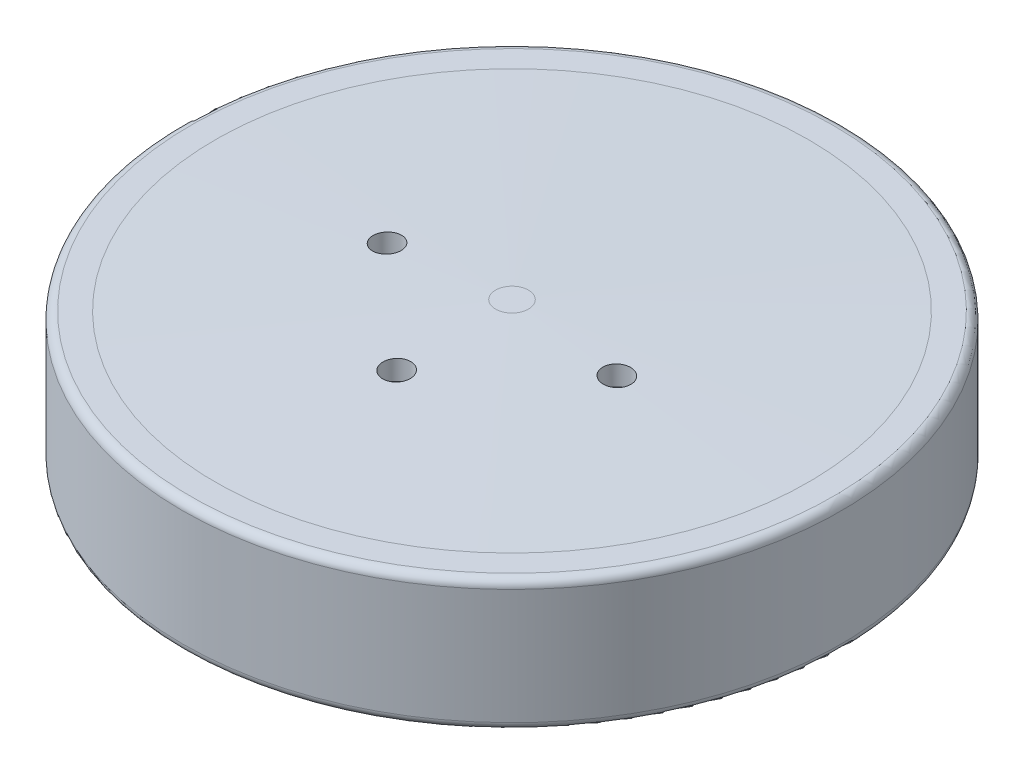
ISO-10303-21;
HEADER;
FILE_DESCRIPTION(('STEP AP214'),'2;1');
FILE_NAME('part.step','',(''),(''),'','','');
FILE_SCHEMA(('AUTOMOTIVE_DESIGN { 1 0 10303 214 1 1 1 1 }'));
ENDSEC;
DATA;
#1=APPLICATION_CONTEXT('core data for automotive mechanical design processes');
#2=APPLICATION_PROTOCOL_DEFINITION('international standard','automotive_design',2000,#1);
#3=PRODUCT_CONTEXT('',#1,'mechanical');
#4=PRODUCT('Part','Part','',(#3));
#5=PRODUCT_RELATED_PRODUCT_CATEGORY('part','',(#4));
#6=PRODUCT_DEFINITION_FORMATION('','',#4);
#7=PRODUCT_DEFINITION_CONTEXT('part definition',#1,'design');
#8=PRODUCT_DEFINITION('design','',#6,#7);
#9=PRODUCT_DEFINITION_SHAPE('','',#8);
#10=(LENGTH_UNIT() NAMED_UNIT(*) SI_UNIT(.MILLI.,.METRE.));
#11=(NAMED_UNIT(*) PLANE_ANGLE_UNIT() SI_UNIT($,.RADIAN.));
#12=(NAMED_UNIT(*) SI_UNIT($,.STERADIAN.) SOLID_ANGLE_UNIT());
#13=UNCERTAINTY_MEASURE_WITH_UNIT(LENGTH_MEASURE(1.E-05),#10,'distance_accuracy_value','');
#14=(GEOMETRIC_REPRESENTATION_CONTEXT(3) GLOBAL_UNCERTAINTY_ASSIGNED_CONTEXT((#13)) GLOBAL_UNIT_ASSIGNED_CONTEXT((#10,
#11,#12)) REPRESENTATION_CONTEXT('',''));
#15=CARTESIAN_POINT('',(0.,0.,0.));
#16=DIRECTION('',(0.,0.,1.));
#17=DIRECTION('',(1.,0.,0.));
#18=AXIS2_PLACEMENT_3D('',#15,#16,#17);
#19=CARTESIAN_POINT('',(-63.5,0.,0.));
#20=DIRECTION('',(0.,1.,0.));
#21=DIRECTION('',(0.,0.,1.));
#22=AXIS2_PLACEMENT_3D('',#19,#20,#21);
#23=PLANE('',#22);
#24=CARTESIAN_POINT('',(-23.9014000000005,0.,41.3984391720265));
#25=DIRECTION('',(0.,-1.,0.));
#26=DIRECTION('',(0.,0.,-1.));
#27=AXIS2_PLACEMENT_3D('',#24,#25,#26);
#28=CIRCLE('',#27,1.72719999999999);
#29=CARTESIAN_POINT('',(-23.9014000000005,0.,39.6712391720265));
#30=VERTEX_POINT('',#29);
#31=EDGE_CURVE('E107',#30,#30,#28,.T.);
#32=ORIENTED_EDGE('',*,*,#31,.F.);
#33=EDGE_LOOP('',(#32));
#34=FACE_BOUND('',#33,.T.);
#35=CARTESIAN_POINT('',(-5.00707752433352E-13,0.,47.8028));
#36=DIRECTION('',(0.,-1.,0.));
#37=DIRECTION('',(0.,0.,-1.));
#38=AXIS2_PLACEMENT_3D('',#35,#36,#37);
#39=CIRCLE('',#38,1.72719999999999);
#40=CARTESIAN_POINT('',(-5.00707752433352E-13,0.,46.0756));
#41=VERTEX_POINT('',#40);
#42=EDGE_CURVE('E122',#41,#41,#39,.T.);
#43=ORIENTED_EDGE('',*,*,#42,.F.);
#44=EDGE_LOOP('',(#43));
#45=FACE_BOUND('',#44,.T.);
#46=CARTESIAN_POINT('',(23.9013999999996,0.,41.398439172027));
#47=DIRECTION('',(0.,-1.,0.));
#48=DIRECTION('',(0.,0.,-1.));
#49=AXIS2_PLACEMENT_3D('',#46,#47,#48);
#50=CIRCLE('',#49,1.72719999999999);
#51=CARTESIAN_POINT('',(23.9013999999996,0.,39.671239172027));
#52=VERTEX_POINT('',#51);
#53=EDGE_CURVE('E128',#52,#52,#50,.T.);
#54=ORIENTED_EDGE('',*,*,#53,.F.);
#55=EDGE_LOOP('',(#54));
#56=FACE_BOUND('',#55,.T.);
#57=CARTESIAN_POINT('',(41.3984391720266,0.,23.9014000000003));
#58=DIRECTION('',(0.,-1.,0.));
#59=DIRECTION('',(0.,0.,-1.));
#60=AXIS2_PLACEMENT_3D('',#57,#58,#59);
#61=CIRCLE('',#60,1.72719999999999);
#62=CARTESIAN_POINT('',(41.3984391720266,0.,22.1742000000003));
#63=VERTEX_POINT('',#62);
#64=EDGE_CURVE('E134',#63,#63,#61,.T.);
#65=ORIENTED_EDGE('',*,*,#64,.F.);
#66=EDGE_LOOP('',(#65));
#67=FACE_BOUND('',#66,.T.);
#68=CARTESIAN_POINT('',(47.8028,0.,0.));
#69=DIRECTION('',(0.,-1.,0.));
#70=DIRECTION('',(0.,0.,-1.));
#71=AXIS2_PLACEMENT_3D('',#68,#69,#70);
#72=CIRCLE('',#71,1.72719999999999);
#73=CARTESIAN_POINT('',(47.8028,0.,-1.72719999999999));
#74=VERTEX_POINT('',#73);
#75=EDGE_CURVE('E140',#74,#74,#72,.T.);
#76=ORIENTED_EDGE('',*,*,#75,.F.);
#77=EDGE_LOOP('',(#76));
#78=FACE_BOUND('',#77,.T.);
#79=CARTESIAN_POINT('',(41.3984391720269,0.,-23.9013999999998));
#80=DIRECTION('',(0.,-1.,0.));
#81=DIRECTION('',(0.,0.,-1.));
#82=AXIS2_PLACEMENT_3D('',#79,#80,#81);
#83=CIRCLE('',#82,1.72719999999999);
#84=CARTESIAN_POINT('',(41.3984391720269,0.,-25.6285999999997));
#85=VERTEX_POINT('',#84);
#86=EDGE_CURVE('E147',#85,#85,#83,.T.);
#87=ORIENTED_EDGE('',*,*,#86,.F.);
#88=EDGE_LOOP('',(#87));
#89=FACE_BOUND('',#88,.T.);
#90=CARTESIAN_POINT('',(23.9014000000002,0.,-41.3984391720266));
#91=DIRECTION('',(0.,-1.,0.));
#92=DIRECTION('',(0.,0.,-1.));
#93=AXIS2_PLACEMENT_3D('',#90,#91,#92);
#94=CIRCLE('',#93,1.72719999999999);
#95=CARTESIAN_POINT('',(23.9014000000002,0.,-43.1256391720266));
#96=VERTEX_POINT('',#95);
#97=EDGE_CURVE('E153',#96,#96,#94,.T.);
#98=ORIENTED_EDGE('',*,*,#97,.F.);
#99=EDGE_LOOP('',(#98));
#100=FACE_BOUND('',#99,.T.);
#101=CARTESIAN_POINT('',(-23.9013999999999,0.,-41.3984391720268));
#102=DIRECTION('',(0.,-1.,0.));
#103=DIRECTION('',(0.,0.,-1.));
#104=AXIS2_PLACEMENT_3D('',#101,#102,#103);
#105=CIRCLE('',#104,1.72719999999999);
#106=CARTESIAN_POINT('',(-23.9013999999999,0.,-43.1256391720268));
#107=VERTEX_POINT('',#106);
#108=EDGE_CURVE('E166',#107,#107,#105,.T.);
#109=ORIENTED_EDGE('',*,*,#108,.F.);
#110=EDGE_LOOP('',(#109));
#111=FACE_BOUND('',#110,.T.);
#112=CARTESIAN_POINT('',(-41.3984391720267,0.,-23.9014));
#113=DIRECTION('',(0.,-1.,0.));
#114=DIRECTION('',(0.,0.,-1.));
#115=AXIS2_PLACEMENT_3D('',#112,#113,#114);
#116=CIRCLE('',#115,1.72719999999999);
#117=CARTESIAN_POINT('',(-41.3984391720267,0.,-25.6286));
#118=VERTEX_POINT('',#117);
#119=EDGE_CURVE('E172',#118,#118,#116,.T.);
#120=ORIENTED_EDGE('',*,*,#119,.F.);
#121=EDGE_LOOP('',(#120));
#122=FACE_BOUND('',#121,.T.);
#123=CARTESIAN_POINT('',(-47.8028,0.,0.));
#124=DIRECTION('',(0.,-1.,0.));
#125=DIRECTION('',(0.,0.,-1.));
#126=AXIS2_PLACEMENT_3D('',#123,#124,#125);
#127=CIRCLE('',#126,1.72719999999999);
#128=CARTESIAN_POINT('',(-47.8028,0.,-1.72719999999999));
#129=VERTEX_POINT('',#128);
#130=EDGE_CURVE('E179',#129,#129,#127,.T.);
#131=ORIENTED_EDGE('',*,*,#130,.F.);
#132=EDGE_LOOP('',(#131));
#133=FACE_BOUND('',#132,.T.);
#134=CARTESIAN_POINT('',(0.,0.,0.));
#135=DIRECTION('',(0.,-1.,0.));
#136=DIRECTION('',(0.,0.,-1.));
#137=AXIS2_PLACEMENT_3D('',#134,#135,#136);
#138=CIRCLE('',#137,42.5);
#139=CARTESIAN_POINT('',(0.,0.,-42.5));
#140=VERTEX_POINT('',#139);
#141=EDGE_CURVE('E233',#140,#140,#138,.T.);
#142=ORIENTED_EDGE('',*,*,#141,.F.);
#143=EDGE_LOOP('',(#142));
#144=FACE_BOUND('',#143,.T.);
#145=CARTESIAN_POINT('',(0.,0.,0.));
#146=DIRECTION('',(0.,-1.,0.));
#147=DIRECTION('',(0.,0.,-1.));
#148=AXIS2_PLACEMENT_3D('',#145,#146,#147);
#149=CIRCLE('',#148,53.6448);
#150=CARTESIAN_POINT('',(0.,0.,-53.6448));
#151=VERTEX_POINT('',#150);
#152=EDGE_CURVE('E210',#151,#151,#149,.T.);
#153=ORIENTED_EDGE('',*,*,#152,.T.);
#154=EDGE_LOOP('',(#153));
#155=FACE_BOUND('',#154,.T.);
#156=CARTESIAN_POINT('',(1.66902584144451E-13,0.,-47.8028));
#157=DIRECTION('',(0.,-1.,0.));
#158=DIRECTION('',(0.,0.,-1.));
#159=AXIS2_PLACEMENT_3D('',#156,#157,#158);
#160=CIRCLE('',#159,1.72719999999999);
#161=CARTESIAN_POINT('',(1.66902584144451E-13,0.,-49.53));
#162=VERTEX_POINT('',#161);
#163=EDGE_CURVE('E159',#162,#162,#160,.T.);
#164=ORIENTED_EDGE('',*,*,#163,.F.);
#165=EDGE_LOOP('',(#164));
#166=FACE_BOUND('',#165,.T.);
#167=CARTESIAN_POINT('',(-41.3984391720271,0.,23.9013999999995));
#168=DIRECTION('',(0.,-1.,0.));
#169=DIRECTION('',(0.,0.,-1.));
#170=AXIS2_PLACEMENT_3D('',#167,#168,#169);
#171=CIRCLE('',#170,1.72719999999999);
#172=CARTESIAN_POINT('',(-41.3984391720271,0.,22.1741999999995));
#173=VERTEX_POINT('',#172);
#174=EDGE_CURVE('E108',#173,#173,#171,.T.);
#175=ORIENTED_EDGE('',*,*,#174,.F.);
#176=EDGE_LOOP('',(#175));
#177=FACE_BOUND('',#176,.T.);
#178=ADVANCED_FACE('F45',(#34,#45,#56,#67,#78,#89,#100,#111,#122,#133,#144,#155,#166,#177),#23,.F.);
#179=CARTESIAN_POINT('',(0.,0.,0.));
#180=DIRECTION('',(0.,-1.,0.));
#181=DIRECTION('',(0.,0.,-1.));
#182=AXIS2_PLACEMENT_3D('',#179,#180,#181);
#183=CYLINDRICAL_SURFACE('',#182,63.5);
#184=CARTESIAN_POINT('',(0.,1.5875,0.));
#185=DIRECTION('',(0.,1.,0.));
#186=DIRECTION('',(0.,0.,1.));
#187=AXIS2_PLACEMENT_3D('',#184,#185,#186);
#188=CIRCLE('',#187,63.5);
#189=CARTESIAN_POINT('',(0.,1.5875,63.5));
#190=VERTEX_POINT('',#189);
#191=EDGE_CURVE('E55',#190,#190,#188,.T.);
#192=ORIENTED_EDGE('',*,*,#191,.T.);
#193=EDGE_LOOP('',(#192));
#194=FACE_BOUND('',#193,.T.);
#195=CARTESIAN_POINT('',(0.,23.8125,0.));
#196=DIRECTION('',(0.,-1.,0.));
#197=DIRECTION('',(0.,0.,-1.));
#198=AXIS2_PLACEMENT_3D('',#195,#196,#197);
#199=CIRCLE('',#198,63.5);
#200=CARTESIAN_POINT('',(0.,23.8125,-63.5));
#201=VERTEX_POINT('',#200);
#202=EDGE_CURVE('E241',#201,#201,#199,.T.);
#203=ORIENTED_EDGE('',*,*,#202,.T.);
#204=EDGE_LOOP('',(#203));
#205=FACE_BOUND('',#204,.T.);
#206=ADVANCED_FACE('F401',(#194,#205),#183,.T.);
#207=CARTESIAN_POINT('',(0.,0.,0.));
#208=DIRECTION('',(0.,1.,0.));
#209=DIRECTION('',(0.,0.,1.));
#210=AXIS2_PLACEMENT_3D('',#207,#208,#209);
#211=CIRCLE('',#210,61.9125);
#212=CARTESIAN_POINT('',(0.,0.,61.9125));
#213=VERTEX_POINT('',#212);
#214=EDGE_CURVE('E237',#213,#213,#211,.F.);
#215=ORIENTED_EDGE('',*,*,#214,.T.);
#216=EDGE_LOOP('',(#215));
#217=FACE_BOUND('',#216,.T.);
#218=CARTESIAN_POINT('',(0.,0.,0.));
#219=DIRECTION('',(0.,-1.,0.));
#220=DIRECTION('',(0.,0.,-1.));
#221=AXIS2_PLACEMENT_3D('',#218,#219,#220);
#222=CIRCLE('',#221,58.5216);
#223=CARTESIAN_POINT('',(0.,0.,-58.5216));
#224=VERTEX_POINT('',#223);
#225=EDGE_CURVE('E214',#224,#224,#222,.T.);
#226=ORIENTED_EDGE('',*,*,#225,.F.);
#227=EDGE_LOOP('',(#226));
#228=FACE_BOUND('',#227,.T.);
#229=ADVANCED_FACE('F404',(#217,#228),#23,.F.);
#230=CARTESIAN_POINT('',(-3.175,27.2848485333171,0.));
#231=DIRECTION('',(0.,-1.,0.));
#232=DIRECTION('',(0.,0.,-1.));
#233=AXIS2_PLACEMENT_3D('',#230,#231,#232);
#234=PLANE('',#233);
#235=CARTESIAN_POINT('',(0.,27.2848485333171,0.));
#236=DIRECTION('',(0.,-1.,0.));
#237=DIRECTION('',(0.,0.,-1.));
#238=AXIS2_PLACEMENT_3D('',#235,#236,#237);
#239=CIRCLE('',#238,3.175);
#240=CARTESIAN_POINT('',(0.,27.2848485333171,-3.175));
#241=VERTEX_POINT('',#240);
#242=EDGE_CURVE('E221',#241,#241,#239,.T.);
#243=ORIENTED_EDGE('',*,*,#242,.F.);
#244=EDGE_LOOP('',(#243));
#245=FACE_BOUND('',#244,.T.);
#246=ADVANCED_FACE('F397',(#245),#234,.F.);
#247=CARTESIAN_POINT('',(0.,27.2848485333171,0.));
#248=DIRECTION('',(0.,-1.,0.));
#249=DIRECTION('',(0.,0.,-1.));
#250=AXIS2_PLACEMENT_3D('',#247,#248,#249);
#251=CONICAL_SURFACE('',#250,3.175,1.53588974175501);
#252=CARTESIAN_POINT('',(-1.91928773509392,26.6830174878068,20.3187197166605));
#253=CARTESIAN_POINT('',(-1.81225702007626,26.6871148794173,20.2109679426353));
#254=CARTESIAN_POINT('',(-1.69604698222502,26.6909082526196,20.1121671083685));
#255=CARTESIAN_POINT('',(-1.44858109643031,26.697739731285,19.9353814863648));
#256=CARTESIAN_POINT('',(-1.31730742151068,26.7007769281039,19.8574217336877));
#257=CARTESIAN_POINT('',(-1.04356755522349,26.7059734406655,19.7246697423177));
#258=CARTESIAN_POINT('',(-0.901106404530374,26.7081331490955,19.6698671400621));
#259=CARTESIAN_POINT('',(-0.60903431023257,26.7114877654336,19.5849678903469));
#260=CARTESIAN_POINT('',(-0.459425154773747,26.7126829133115,19.55486509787));
#261=CARTESIAN_POINT('',(-0.157324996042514,26.7140596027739,19.5202038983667));
#262=CARTESIAN_POINT('',(-0.00483503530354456,26.7142415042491,19.5156364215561));
#263=CARTESIAN_POINT('',(0.298752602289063,26.7135849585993,19.5321532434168));
#264=CARTESIAN_POINT('',(0.449850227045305,26.712746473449,19.5532384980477));
#265=CARTESIAN_POINT('',(0.746321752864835,26.7100844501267,19.6204525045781));
#266=CARTESIAN_POINT('',(0.891696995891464,26.7082611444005,19.6665753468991));
#267=CARTESIAN_POINT('',(1.17263839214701,26.7037042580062,19.7825463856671));
#268=CARTESIAN_POINT('',(1.30820455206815,26.7009706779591,19.8523945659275));
#269=CARTESIAN_POINT('',(1.56573336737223,26.6947003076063,20.013857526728));
#270=CARTESIAN_POINT('',(1.68769119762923,26.6911632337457,20.105479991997));
#271=CARTESIAN_POINT('',(1.91449567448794,26.6834202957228,20.3078736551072));
#272=CARTESIAN_POINT('',(2.01934228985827,26.6792144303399,20.4186448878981));
#273=CARTESIAN_POINT('',(2.20902579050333,26.670281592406,20.6562747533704));
#274=CARTESIAN_POINT('',(2.29384878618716,26.6655542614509,20.7831444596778));
#275=CARTESIAN_POINT('',(2.44099257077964,26.6557406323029,21.0493106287));
#276=CARTESIAN_POINT('',(2.50331325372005,26.6506543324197,21.1886071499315));
#277=CARTESIAN_POINT('',(2.60372191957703,26.6402807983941,21.47576808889));
#278=CARTESIAN_POINT('',(2.64179459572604,26.6349934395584,21.6236378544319));
#279=CARTESIAN_POINT('',(2.69256670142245,26.6243782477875,21.9236697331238));
#280=CARTESIAN_POINT('',(2.70526608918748,26.6190504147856,22.0758318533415));
#281=CARTESIAN_POINT('',(2.70493057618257,26.6085017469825,22.3801751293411));
#282=CARTESIAN_POINT('',(2.6918883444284,26.6032809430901,22.5323562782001));
#283=CARTESIAN_POINT('',(2.64042206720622,26.5930855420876,22.8323730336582));
#284=CARTESIAN_POINT('',(2.60199802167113,26.5881109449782,22.9802086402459));
#285=CARTESIAN_POINT('',(2.50086065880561,26.5785326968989,23.2673166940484));
#286=CARTESIAN_POINT('',(2.43815028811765,26.5739290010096,23.4065901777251));
#287=CARTESIAN_POINT('',(2.29021557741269,26.5652012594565,23.6726340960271));
#288=CARTESIAN_POINT('',(2.20499128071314,26.5610772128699,23.7994045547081));
#289=CARTESIAN_POINT('',(2.01448445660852,26.5534042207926,24.0367863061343));
#290=CARTESIAN_POINT('',(1.90921020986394,26.5498550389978,24.1474042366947));
#291=CARTESIAN_POINT('',(1.681566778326,26.5434075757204,24.3493950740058));
#292=CARTESIAN_POINT('',(1.5591976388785,26.5405092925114,24.4407680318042));
#293=CARTESIAN_POINT('',(1.30090533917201,26.5354266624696,24.6016251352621));
#294=CARTESIAN_POINT('',(1.16498914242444,26.5332419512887,24.6711204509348));
#295=CARTESIAN_POINT('',(0.883409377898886,26.5296298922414,24.7863067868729));
#296=CARTESIAN_POINT('',(0.73774583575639,26.5282025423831,24.8319978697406));
#297=CARTESIAN_POINT('',(0.440872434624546,26.5261348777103,24.8982599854));
#298=CARTESIAN_POINT('',(0.289664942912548,26.5254942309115,24.9188416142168));
#299=CARTESIAN_POINT('',(-0.0140606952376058,26.5250118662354,24.9343339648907));
#300=CARTESIAN_POINT('',(-0.166578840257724,26.5251701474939,24.9292447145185));
#301=CARTESIAN_POINT('',(-0.468564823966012,26.5262823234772,24.8935438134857));
#302=CARTESIAN_POINT('',(-0.6180332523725,26.5272360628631,24.8629371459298));
#303=CARTESIAN_POINT('',(-0.909708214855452,26.5299195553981,24.7770792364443));
#304=CARTESIAN_POINT('',(-1.05191475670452,26.5316493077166,24.7218280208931));
#305=CARTESIAN_POINT('',(-1.32504430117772,26.5358494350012,24.5882470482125));
#306=CARTESIAN_POINT('',(-1.45596628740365,26.5383198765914,24.5099152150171));
#307=CARTESIAN_POINT('',(-1.70280085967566,26.5439495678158,24.3324024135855));
#308=CARTESIAN_POINT('',(-1.81871339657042,26.5471088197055,24.2332213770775));
#309=CARTESIAN_POINT('',(-2.0322827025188,26.5540494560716,24.0167908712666));
#310=CARTESIAN_POINT('',(-2.12993312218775,26.5578310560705,23.8995351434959));
#311=CARTESIAN_POINT('',(-2.30416401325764,26.5659316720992,23.6503110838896));
#312=CARTESIAN_POINT('',(-2.38074438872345,26.5702506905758,23.5183426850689));
#313=CARTESIAN_POINT('',(-2.5107031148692,26.5793288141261,23.2433677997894));
#314=CARTESIAN_POINT('',(-2.56406946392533,26.5840881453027,23.1003556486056));
#315=CARTESIAN_POINT('',(-2.64603234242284,26.5939297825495,22.8074177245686));
#316=CARTESIAN_POINT('',(-2.67462977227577,26.5990120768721,22.6574922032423));
#317=CARTESIAN_POINT('',(-2.70625834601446,26.6093723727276,22.354919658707));
#318=CARTESIAN_POINT('',(-2.70928005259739,26.6146504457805,22.202271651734));
#319=CARTESIAN_POINT('',(-2.68964307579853,26.625259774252,21.8985964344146));
#320=CARTESIAN_POINT('',(-2.66697797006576,26.6305910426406,21.7475696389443));
#321=CARTESIAN_POINT('',(-2.5965863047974,26.6411559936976,21.4513687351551));
#322=CARTESIAN_POINT('',(-2.54884150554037,26.6463896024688,21.3061989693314));
#323=CARTESIAN_POINT('',(-2.42965875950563,26.6565911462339,21.026066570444));
#324=CARTESIAN_POINT('',(-2.35824934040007,26.6615593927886,20.8910918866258));
#325=CARTESIAN_POINT('',(-2.22464709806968,26.6692893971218,20.6830549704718));
#326=CARTESIAN_POINT('',(-2.16899542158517,26.6721814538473,20.6057169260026));
#327=CARTESIAN_POINT('',(-2.04986063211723,26.6777613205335,20.4573201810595));
#328=CARTESIAN_POINT('',(-1.98637751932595,26.6804491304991,20.3862614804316));
#329=CARTESIAN_POINT('',(-1.91928773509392,26.6830174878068,20.3187197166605));
#330=B_SPLINE_CURVE_WITH_KNOTS('',3,(#252,#253,#254,#255,#256,#257,#258,#259,#260,#261,#262,
#263,#264,#265,#266,#267,#268,#269,#270,#271,#272,#273,#274,#275,#276,#277,#278,#279,#280,#281,
#282,#283,#284,#285,#286,#287,#288,#289,#290,#291,#292,#293,#294,#295,#296,#297,#298,#299,#300,
#301,#302,#303,#304,#305,#306,#307,#308,#309,#310,#311,#312,#313,#314,#315,#316,#317,#318,#319,
#320,#321,#322,#323,#324,#325,#326,#327,#328,#329),.UNSPECIFIED.,.T.,.F.,(4,2,2,2,2,2,2,2,2,2,2,
2,2,2,2,2,2,2,2,2,2,2,2,2,2,2,2,2,2,2,2,2,2,2,2,2,2,2,4),(0.,0.455443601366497,
0.911431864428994,1.3672158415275,1.82288639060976,2.27839508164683,2.73392074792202,
3.189338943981,3.64475682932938,4.10033568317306,4.55591536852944,5.01181014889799,
5.4677070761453,5.92389150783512,6.38007669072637,6.83639180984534,7.29270693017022,
7.7489667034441,8.20522559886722,8.66129646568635,9.11736612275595,9.57320254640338,
10.0290377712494,10.484680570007,10.9403228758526,11.3958762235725,11.8514290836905,
12.3070229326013,12.7626182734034,13.2183717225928,13.6741272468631,14.1301181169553,
14.5860924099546,15.042234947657,15.4984915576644,15.9550804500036,16.4111209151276,
16.6966054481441,16.9820899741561),.UNSPECIFIED.);
#331=CARTESIAN_POINT('',(-1.91928773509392,26.6830174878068,20.3187197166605));
#332=VERTEX_POINT('',#331);
#333=EDGE_CURVE('E894',#332,#332,#330,.T.);
#334=ORIENTED_EDGE('',*,*,#333,.T.);
#335=EDGE_LOOP('',(#334));
#336=FACE_BOUND('',#335,.T.);
#337=CARTESIAN_POINT('',(20.2337161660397,26.6891440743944,0.0181766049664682));
#338=CARTESIAN_POINT('',(20.3415507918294,26.6853816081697,-0.0889660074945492));
#339=CARTESIAN_POINT('',(20.4585109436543,26.6812711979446,-0.187069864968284));
#340=CARTESIAN_POINT('',(20.7073315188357,26.6725018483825,-0.362313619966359));
#341=CARTESIAN_POINT('',(20.8392098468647,26.6678422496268,-0.439427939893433));
#342=CARTESIAN_POINT('',(21.1139793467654,26.6581397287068,-0.570374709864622));
#343=CARTESIAN_POINT('',(21.2568649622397,26.6530969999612,-0.624218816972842));
#344=CARTESIAN_POINT('',(21.5496016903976,26.6427893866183,-0.707132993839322));
#345=CARTESIAN_POINT('',(21.6994510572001,26.637524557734,-0.73620923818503));
#346=CARTESIAN_POINT('',(22.0019733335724,26.6269273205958,-0.768800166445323));
#347=CARTESIAN_POINT('',(22.1546475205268,26.6215948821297,-0.772302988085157));
#348=CARTESIAN_POINT('',(22.4584242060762,26.6110152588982,-0.753614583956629));
#349=CARTESIAN_POINT('',(22.6095266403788,26.6057680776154,-0.731422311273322));
#350=CARTESIAN_POINT('',(22.9058777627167,26.595498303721,-0.661966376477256));
#351=CARTESIAN_POINT('',(23.051125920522,26.5904757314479,-0.614700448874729));
#352=CARTESIAN_POINT('',(23.3316269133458,26.5807821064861,-0.496433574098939));
#353=CARTESIAN_POINT('',(23.4668797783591,26.5761110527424,-0.425432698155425));
#354=CARTESIAN_POINT('',(23.7235110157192,26.5672334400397,-0.261729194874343));
#355=CARTESIAN_POINT('',(23.8448930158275,26.563026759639,-0.169032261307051));
#356=CARTESIAN_POINT('',(24.0703700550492,26.5551728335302,0.0354452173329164));
#357=CARTESIAN_POINT('',(24.1744651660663,26.5515255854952,0.14722568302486));
#358=CARTESIAN_POINT('',(24.3623594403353,26.5448725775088,0.386640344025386));
#359=CARTESIAN_POINT('',(24.4461682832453,26.5418665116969,0.514266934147));
#360=CARTESIAN_POINT('',(24.5911675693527,26.536557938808,0.781793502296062));
#361=CARTESIAN_POINT('',(24.6523580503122,26.5342554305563,0.92169345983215));
#362=CARTESIAN_POINT('',(24.750351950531,26.5304030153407,1.20972083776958));
#363=CARTESIAN_POINT('',(24.7871674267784,26.5288527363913,1.35784415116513));
#364=CARTESIAN_POINT('',(24.8354102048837,26.5265348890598,1.65817487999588));
#365=CARTESIAN_POINT('',(24.8468375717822,26.5257673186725,1.81038228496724));
#366=CARTESIAN_POINT('',(24.8439781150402,26.5250306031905,2.11450546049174));
#367=CARTESIAN_POINT('',(24.8297000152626,26.5250611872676,2.26642131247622));
#368=CARTESIAN_POINT('',(24.7758521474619,26.525919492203,2.56570000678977));
#369=CARTESIAN_POINT('',(24.7362823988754,26.5267472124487,2.71306285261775));
#370=CARTESIAN_POINT('',(24.6329808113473,26.5291828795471,2.9990412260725));
#371=CARTESIAN_POINT('',(24.5692508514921,26.5307907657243,3.13765743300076));
#372=CARTESIAN_POINT('',(24.4194410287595,26.5347537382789,3.40222283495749));
#373=CARTESIAN_POINT('',(24.3333611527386,26.5371088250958,3.52817202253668));
#374=CARTESIAN_POINT('',(24.1412784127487,26.542517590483,3.76385765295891));
#375=CARTESIAN_POINT('',(24.0352714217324,26.5455714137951,3.87359072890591));
#376=CARTESIAN_POINT('',(23.8063585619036,26.552312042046,4.07370444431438));
#377=CARTESIAN_POINT('',(23.6834526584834,26.5559988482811,4.16408504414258));
#378=CARTESIAN_POINT('',(23.4241758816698,26.5639257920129,4.32297066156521));
#379=CARTESIAN_POINT('',(23.2877992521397,26.5681661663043,4.39146627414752));
#380=CARTESIAN_POINT('',(23.005497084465,26.5771017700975,4.5045922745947));
#381=CARTESIAN_POINT('',(22.8595715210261,26.5817970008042,4.54922259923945));
#382=CARTESIAN_POINT('',(22.5622347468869,26.5915322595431,4.61337479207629));
#383=CARTESIAN_POINT('',(22.4108207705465,26.5965724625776,4.63288381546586));
#384=CARTESIAN_POINT('',(22.1068738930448,26.6068683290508,4.64620242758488));
#385=CARTESIAN_POINT('',(21.9543409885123,26.612123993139,4.64001193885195));
#386=CARTESIAN_POINT('',(21.6524212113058,26.6227126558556,4.60210179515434));
#387=CARTESIAN_POINT('',(21.5030356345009,26.6280456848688,4.5703718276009));
#388=CARTESIAN_POINT('',(21.2117138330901,26.6386356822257,4.48227019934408));
#389=CARTESIAN_POINT('',(21.0697776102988,26.6438926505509,4.42589853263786));
#390=CARTESIAN_POINT('',(20.7973691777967,26.6541721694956,4.29010359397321));
#391=CARTESIAN_POINT('',(20.6668981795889,26.659194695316,4.2106778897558));
#392=CARTESIAN_POINT('',(20.421144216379,26.6688427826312,4.03102764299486));
#393=CARTESIAN_POINT('',(20.3058612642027,26.6734683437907,3.93080308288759));
#394=CARTESIAN_POINT('',(20.093795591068,26.682162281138,3.71243009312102));
#395=CARTESIAN_POINT('',(19.9970072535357,26.6862308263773,3.59428712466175));
#396=CARTESIAN_POINT('',(19.8246435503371,26.6936641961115,3.34340571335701));
#397=CARTESIAN_POINT('',(19.7490681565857,26.697029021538,3.21066728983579));
#398=CARTESIAN_POINT('',(19.6213263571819,26.7029239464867,2.93445114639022));
#399=CARTESIAN_POINT('',(19.5691453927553,26.7054545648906,2.79098017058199));
#400=CARTESIAN_POINT('',(19.4896151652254,26.7095825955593,2.49730639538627));
#401=CARTESIAN_POINT('',(19.4622648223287,26.7111800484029,2.34710388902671));
#402=CARTESIAN_POINT('',(19.4331853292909,26.7133751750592,2.0443525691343));
#403=CARTESIAN_POINT('',(19.4314359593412,26.7139736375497,1.89180570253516));
#404=CARTESIAN_POINT('',(19.4535641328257,26.7141480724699,1.5885398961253));
#405=CARTESIAN_POINT('',(19.4774479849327,26.7137237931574,1.43782141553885));
#406=CARTESIAN_POINT('',(19.5501654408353,26.711870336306,1.14252647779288));
#407=CARTESIAN_POINT('',(19.5990027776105,26.7104410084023,0.99795094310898));
#408=CARTESIAN_POINT('',(19.7202110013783,26.7066370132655,0.719182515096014));
#409=CARTESIAN_POINT('',(19.7925535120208,26.704263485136,0.584977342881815));
#410=CARTESIAN_POINT('',(19.9273486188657,26.6997238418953,0.378561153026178));
#411=CARTESIAN_POINT('',(19.9832927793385,26.6978152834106,0.302013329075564));
#412=CARTESIAN_POINT('',(20.102882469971,26.6936975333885,0.155199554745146));
#413=CARTESIAN_POINT('',(20.1665279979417,26.6914883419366,0.0849336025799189));
#414=CARTESIAN_POINT('',(20.2337161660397,26.6891440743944,0.0181766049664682));
#415=B_SPLINE_CURVE_WITH_KNOTS('',3,(#337,#338,#339,#340,#341,#342,#343,#344,#345,#346,#347,
#348,#349,#350,#351,#352,#353,#354,#355,#356,#357,#358,#359,#360,#361,#362,#363,#364,#365,#366,
#367,#368,#369,#370,#371,#372,#373,#374,#375,#376,#377,#378,#379,#380,#381,#382,#383,#384,#385,
#386,#387,#388,#389,#390,#391,#392,#393,#394,#395,#396,#397,#398,#399,#400,#401,#402,#403,#404,
#405,#406,#407,#408,#409,#410,#411,#412,#413,#414),.UNSPECIFIED.,.T.,.F.,(4,2,2,2,2,2,2,2,2,2,2,
2,2,2,2,2,2,2,2,2,2,2,2,2,2,2,2,2,2,2,2,2,2,2,2,2,2,2,4),(0.,0.455831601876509,
0.912216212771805,1.36837193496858,1.8244139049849,2.28066739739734,2.73693947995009,
3.19325279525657,3.6495647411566,4.10575706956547,4.5619475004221,5.01791982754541,
5.47389139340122,5.92963724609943,6.38538193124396,6.84097197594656,7.29656167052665,
7.75211593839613,8.2076704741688,8.66331946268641,9.11896938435,9.57481485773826,
10.0306615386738,10.4867412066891,10.9428222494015,11.3990875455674,11.8553529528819,
12.3116665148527,12.7679804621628,13.224155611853,13.6803301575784,14.1362204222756,
14.5920908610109,15.0476012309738,15.5032237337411,15.9589144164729,16.4140570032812,
16.6980705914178,16.9820840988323),.UNSPECIFIED.);
#416=CARTESIAN_POINT('',(20.2337161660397,26.6891440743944,0.0181766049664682));
#417=VERTEX_POINT('',#416);
#418=EDGE_CURVE('E256',#417,#417,#415,.T.);
#419=ORIENTED_EDGE('',*,*,#418,.T.);
#420=EDGE_LOOP('',(#419));
#421=FACE_BOUND('',#420,.T.);
#422=CARTESIAN_POINT('',(-24.0569286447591,26.5556349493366,0.0279559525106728));
#423=CARTESIAN_POINT('',(-23.949644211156,26.5593857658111,-0.0797359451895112));
#424=CARTESIAN_POINT('',(-23.8331879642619,26.5634312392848,-0.178437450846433));
#425=CARTESIAN_POINT('',(-23.5852660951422,26.5720190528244,-0.354953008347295));
#426=CARTESIAN_POINT('',(-23.4537824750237,26.5765619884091,-0.432741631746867));
#427=CARTESIAN_POINT('',(-23.1796824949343,26.586032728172,-0.565093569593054));
#428=CARTESIAN_POINT('',(-23.0370717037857,26.5909603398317,-0.619668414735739));
#429=CARTESIAN_POINT('',(-22.744758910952,26.6010786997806,-0.704078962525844));
#430=CARTESIAN_POINT('',(-22.5950586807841,26.6062693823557,-0.733920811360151));
#431=CARTESIAN_POINT('',(-22.2927131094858,26.6167817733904,-0.768056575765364));
#432=CARTESIAN_POINT('',(-22.1400665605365,26.6221035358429,-0.772339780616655));
#433=CARTESIAN_POINT('',(-21.8362157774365,26.6327286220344,-0.75520757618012));
#434=CARTESIAN_POINT('',(-21.6850116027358,26.6380319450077,-0.733791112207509));
#435=CARTESIAN_POINT('',(-21.3883194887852,26.6484642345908,-0.665858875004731));
#436=CARTESIAN_POINT('',(-21.2428324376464,26.6535931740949,-0.619339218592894));
#437=CARTESIAN_POINT('',(-20.9617315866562,26.6635143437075,-0.502514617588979));
#438=CARTESIAN_POINT('',(-20.8261177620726,26.6683065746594,-0.43220973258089));
#439=CARTESIAN_POINT('',(-20.5686464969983,26.6773924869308,-0.269823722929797));
#440=CARTESIAN_POINT('',(-20.4467859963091,26.6816862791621,-0.177747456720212));
#441=CARTESIAN_POINT('',(-20.2202534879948,26.6896234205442,0.0255804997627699));
#442=CARTESIAN_POINT('',(-20.1155813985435,26.6932667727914,0.136832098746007));
#443=CARTESIAN_POINT('',(-19.9264634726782,26.6997638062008,0.375283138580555));
#444=CARTESIAN_POINT('',(-19.8420056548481,26.7026179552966,0.502473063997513));
#445=CARTESIAN_POINT('',(-19.6956427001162,26.7074268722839,0.769242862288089));
#446=CARTESIAN_POINT('',(-19.6337374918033,26.7093816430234,0.908822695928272));
#447=CARTESIAN_POINT('',(-19.5342808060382,26.7123108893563,1.19630355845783));
#448=CARTESIAN_POINT('',(-19.4967121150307,26.7132860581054,1.3441986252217));
#449=CARTESIAN_POINT('',(-19.4469291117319,26.7142178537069,1.64419907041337));
#450=CARTESIAN_POINT('',(-19.4347147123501,26.7141744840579,1.7963044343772));
#451=CARTESIAN_POINT('',(-19.4359867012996,26.7130712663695,2.10033963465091));
#452=CARTESIAN_POINT('',(-19.4494622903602,26.7120118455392,2.2522695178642));
#453=CARTESIAN_POINT('',(-19.5017067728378,26.708921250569,2.55170592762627));
#454=CARTESIAN_POINT('',(-19.5404756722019,26.7068900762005,2.69921245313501));
#455=CARTESIAN_POINT('',(-19.6422078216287,26.7019382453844,2.98563864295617));
#456=CARTESIAN_POINT('',(-19.7051744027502,26.6990174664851,3.12455712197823));
#457=CARTESIAN_POINT('',(-19.8535085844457,26.6924011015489,3.38984930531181));
#458=CARTESIAN_POINT('',(-19.9388762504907,26.6887055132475,3.51622297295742));
#459=CARTESIAN_POINT('',(-20.129644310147,26.6806753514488,3.75292096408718));
#460=CARTESIAN_POINT('',(-20.2350567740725,26.6763403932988,3.86323554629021));
#461=CARTESIAN_POINT('',(-20.4628868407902,26.6671866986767,4.06460273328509));
#462=CARTESIAN_POINT('',(-20.5853045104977,26.6623679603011,4.15565526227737));
#463=CARTESIAN_POINT('',(-20.8437634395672,26.6524037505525,4.31597973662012));
#464=CARTESIAN_POINT('',(-20.9798141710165,26.6472580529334,4.38523639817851));
#465=CARTESIAN_POINT('',(-21.2616072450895,26.6368039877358,4.49992182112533));
#466=CARTESIAN_POINT('',(-21.4073496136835,26.6314956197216,4.54535051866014));
#467=CARTESIAN_POINT('',(-21.7044581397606,26.6208696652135,4.61110751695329));
#468=CARTESIAN_POINT('',(-21.8558267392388,26.6155520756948,4.6314247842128));
#469=CARTESIAN_POINT('',(-22.1598310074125,26.6050567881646,4.6463443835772));
#470=CARTESIAN_POINT('',(-22.3124666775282,26.59987909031,4.64094668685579));
#471=CARTESIAN_POINT('',(-22.6146762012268,26.58979822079,4.60458539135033));
#472=CARTESIAN_POINT('',(-22.7642499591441,26.5848950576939,4.57362099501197));
#473=CARTESIAN_POINT('',(-23.0560809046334,26.5754844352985,4.48699937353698));
#474=CARTESIAN_POINT('',(-23.1983381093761,26.5709769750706,4.43134220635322));
#475=CARTESIAN_POINT('',(-23.4714474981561,26.562465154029,4.29693197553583));
#476=CARTESIAN_POINT('',(-23.6023033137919,26.5584606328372,4.21818630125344));
#477=CARTESIAN_POINT('',(-23.8489392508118,26.5510433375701,4.03982333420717));
#478=CARTESIAN_POINT('',(-23.9647193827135,26.547630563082,3.94020605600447));
#479=CARTESIAN_POINT('',(-24.1778545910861,26.5414726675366,3.7229807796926));
#480=CARTESIAN_POINT('',(-24.2752188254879,26.5387272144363,3.60538177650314));
#481=CARTESIAN_POINT('',(-24.4488227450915,26.5339598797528,3.35549373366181));
#482=CARTESIAN_POINT('',(-24.5250624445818,26.5319379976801,3.22320470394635));
#483=CARTESIAN_POINT('',(-24.6542163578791,26.5286604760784,2.94775763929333));
#484=CARTESIAN_POINT('',(-24.7071412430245,26.5274044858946,2.80460461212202));
#485=CARTESIAN_POINT('',(-24.788208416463,26.5256829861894,2.51144682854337));
#486=CARTESIAN_POINT('',(-24.8163517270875,26.5252174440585,2.361442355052));
#487=CARTESIAN_POINT('',(-24.8470535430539,26.5250861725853,2.05889904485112));
#488=CARTESIAN_POINT('',(-24.8496222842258,26.5254201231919,1.90636124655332));
#489=CARTESIAN_POINT('',(-24.8291237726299,26.5268807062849,1.60298018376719));
#490=CARTESIAN_POINT('',(-24.8060501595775,26.52800753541,1.45213734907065));
#491=CARTESIAN_POINT('',(-24.7349109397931,26.5310313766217,1.15641543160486));
#492=CARTESIAN_POINT('',(-24.6868339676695,26.5329287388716,1.01153909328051));
#493=CARTESIAN_POINT('',(-24.567077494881,26.5374533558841,0.732048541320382));
#494=CARTESIAN_POINT('',(-24.4954264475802,26.5400797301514,0.597422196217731));
#495=CARTESIAN_POINT('',(-24.361658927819,26.5448894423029,0.390199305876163));
#496=CARTESIAN_POINT('',(-24.3060742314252,26.5468685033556,0.313301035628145));
#497=CARTESIAN_POINT('',(-24.1871579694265,26.551071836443,0.165755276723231));
#498=CARTESIAN_POINT('',(-24.1238264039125,26.5532961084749,0.0951077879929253));
#499=CARTESIAN_POINT('',(-24.0569286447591,26.5556349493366,0.0279559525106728));
#500=B_SPLINE_CURVE_WITH_KNOTS('',3,(#422,#423,#424,#425,#426,#427,#428,#429,#430,#431,#432,
#433,#434,#435,#436,#437,#438,#439,#440,#441,#442,#443,#444,#445,#446,#447,#448,#449,#450,#451,
#452,#453,#454,#455,#456,#457,#458,#459,#460,#461,#462,#463,#464,#465,#466,#467,#468,#469,#470,
#471,#472,#473,#474,#475,#476,#477,#478,#479,#480,#481,#482,#483,#484,#485,#486,#487,#488,#489,
#490,#491,#492,#493,#494,#495,#496,#497,#498,#499),.UNSPECIFIED.,.T.,.F.,(4,2,2,2,2,2,2,2,2,2,2,
2,2,2,2,2,2,2,2,2,2,2,2,2,2,2,2,2,2,2,2,2,2,2,2,2,2,2,4),(0.,0.455826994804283,
0.912205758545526,1.36835756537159,1.82439598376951,2.28062549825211,2.73687373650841,
3.19319257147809,3.64951026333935,4.10572622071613,4.56194000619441,5.01788271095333,
5.4738239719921,5.92944238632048,6.3850592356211,6.84048460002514,7.29591007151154,
7.7513982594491,8.20688777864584,8.66265245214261,9.11841891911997,9.57450427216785,
10.0305908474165,10.4868777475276,10.9431651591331,11.3994668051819,11.8557673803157,
12.3119220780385,12.7680764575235,13.2240033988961,13.6799300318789,14.1356477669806,
14.5913467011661,15.0468632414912,15.5024927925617,15.9583296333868,16.4136182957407,
16.6978515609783,16.9820848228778),.UNSPECIFIED.);
#501=CARTESIAN_POINT('',(-24.0569286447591,26.5556349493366,0.0279559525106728));
#502=VERTEX_POINT('',#501);
#503=EDGE_CURVE('E116',#502,#502,#500,.T.);
#504=ORIENTED_EDGE('',*,*,#503,.T.);
#505=EDGE_LOOP('',(#504));
#506=FACE_BOUND('',#505,.T.);
#507=CARTESIAN_POINT('',(0.,25.4,0.));
#508=DIRECTION('',(0.,-1.,0.));
#509=DIRECTION('',(0.,0.,-1.));
#510=AXIS2_PLACEMENT_3D('',#507,#508,#509);
#511=CIRCLE('',#510,57.15);
#512=CARTESIAN_POINT('',(0.,25.4,-57.15));
#513=VERTEX_POINT('',#512);
#514=EDGE_CURVE('E218',#513,#513,#511,.T.);
#515=ORIENTED_EDGE('',*,*,#514,.F.);
#516=EDGE_LOOP('',(#515));
#517=FACE_BOUND('',#516,.T.);
#518=ORIENTED_EDGE('',*,*,#242,.T.);
#519=EDGE_LOOP('',(#518));
#520=FACE_BOUND('',#519,.T.);
#521=ADVANCED_FACE('F262',(#336,#421,#506,#517,#520),#251,.T.);
#522=CARTESIAN_POINT('',(-57.15,25.4,0.));
#523=DIRECTION('',(0.,-1.,0.));
#524=DIRECTION('',(0.,0.,-1.));
#525=AXIS2_PLACEMENT_3D('',#522,#523,#524);
#526=PLANE('',#525);
#527=CARTESIAN_POINT('',(0.,25.4,0.));
#528=DIRECTION('',(0.,-1.,0.));
#529=DIRECTION('',(0.,0.,-1.));
#530=AXIS2_PLACEMENT_3D('',#527,#528,#529);
#531=CIRCLE('',#530,61.9125);
#532=CARTESIAN_POINT('',(0.,25.4,-61.9125));
#533=VERTEX_POINT('',#532);
#534=EDGE_CURVE('E11',#533,#533,#531,.F.);
#535=ORIENTED_EDGE('',*,*,#534,.T.);
#536=EDGE_LOOP('',(#535));
#537=FACE_BOUND('',#536,.T.);
#538=ORIENTED_EDGE('',*,*,#514,.T.);
#539=EDGE_LOOP('',(#538));
#540=FACE_BOUND('',#539,.T.);
#541=ADVANCED_FACE('F390',(#537,#540),#526,.F.);
#542=CARTESIAN_POINT('',(0.,0.126999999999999,0.));
#543=DIRECTION('',(0.,-1.,0.));
#544=DIRECTION('',(0.,0.,-1.));
#545=AXIS2_PLACEMENT_3D('',#542,#543,#544);
#546=TOROIDAL_SURFACE('',#545,58.5216,0.127000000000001);
#547=ORIENTED_EDGE('',*,*,#225,.T.);
#548=EDGE_LOOP('',(#547));
#549=FACE_BOUND('',#548,.T.);
#550=CARTESIAN_POINT('',(0.,0.126999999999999,0.));
#551=DIRECTION('',(0.,-1.,0.));
#552=DIRECTION('',(0.,0.,-1.));
#553=AXIS2_PLACEMENT_3D('',#550,#551,#552);
#554=CIRCLE('',#553,58.3946);
#555=CARTESIAN_POINT('',(0.,0.126999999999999,-58.3946));
#556=VERTEX_POINT('',#555);
#557=EDGE_CURVE('E186',#556,#556,#554,.T.);
#558=ORIENTED_EDGE('',*,*,#557,.F.);
#559=EDGE_LOOP('',(#558));
#560=FACE_BOUND('',#559,.T.);
#561=ADVANCED_FACE('F387',(#549,#560),#546,.T.);
#562=CARTESIAN_POINT('',(0.,0.127,0.));
#563=DIRECTION('',(0.,-1.,0.));
#564=DIRECTION('',(0.,0.,-1.));
#565=AXIS2_PLACEMENT_3D('',#562,#563,#564);
#566=TOROIDAL_SURFACE('',#565,53.6448,0.127000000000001);
#567=CARTESIAN_POINT('',(0.,0.127,0.));
#568=DIRECTION('',(0.,-1.,0.));
#569=DIRECTION('',(0.,0.,-1.));
#570=AXIS2_PLACEMENT_3D('',#567,#568,#569);
#571=CIRCLE('',#570,53.7718);
#572=CARTESIAN_POINT('',(0.,0.127,-53.7718));
#573=VERTEX_POINT('',#572);
#574=EDGE_CURVE('E206',#573,#573,#571,.T.);
#575=ORIENTED_EDGE('',*,*,#574,.T.);
#576=EDGE_LOOP('',(#575));
#577=FACE_BOUND('',#576,.T.);
#578=ORIENTED_EDGE('',*,*,#152,.F.);
#579=EDGE_LOOP('',(#578));
#580=FACE_BOUND('',#579,.T.);
#581=ADVANCED_FACE('F383',(#577,#580),#566,.T.);
#582=CARTESIAN_POINT('',(0.,0.,0.));
#583=DIRECTION('',(0.,-1.,0.));
#584=DIRECTION('',(0.,0.,-1.));
#585=AXIS2_PLACEMENT_3D('',#582,#583,#584);
#586=CYLINDRICAL_SURFACE('',#585,53.7718);
#587=CARTESIAN_POINT('',(0.,2.1971,0.));
#588=DIRECTION('',(0.,-1.,0.));
#589=DIRECTION('',(0.,0.,-1.));
#590=AXIS2_PLACEMENT_3D('',#587,#588,#589);
#591=CIRCLE('',#590,53.7718);
#592=CARTESIAN_POINT('',(0.,2.1971,-53.7718));
#593=VERTEX_POINT('',#592);
#594=EDGE_CURVE('E202',#593,#593,#591,.T.);
#595=ORIENTED_EDGE('',*,*,#594,.T.);
#596=EDGE_LOOP('',(#595));
#597=FACE_BOUND('',#596,.T.);
#598=ORIENTED_EDGE('',*,*,#574,.F.);
#599=EDGE_LOOP('',(#598));
#600=FACE_BOUND('',#599,.T.);
#601=ADVANCED_FACE('F379',(#597,#600),#586,.T.);
#602=CARTESIAN_POINT('',(0.,2.1971,0.));
#603=DIRECTION('',(0.,-1.,0.));
#604=DIRECTION('',(0.,0.,-1.));
#605=AXIS2_PLACEMENT_3D('',#602,#603,#604);
#606=TOROIDAL_SURFACE('',#605,54.2163,0.4445);
#607=CARTESIAN_POINT('',(0.,2.6416,0.));
#608=DIRECTION('',(0.,-1.,0.));
#609=DIRECTION('',(0.,0.,-1.));
#610=AXIS2_PLACEMENT_3D('',#607,#608,#609);
#611=CIRCLE('',#610,54.2163);
#612=CARTESIAN_POINT('',(0.,2.6416,-54.2163));
#613=VERTEX_POINT('',#612);
#614=EDGE_CURVE('E198',#613,#613,#611,.T.);
#615=ORIENTED_EDGE('',*,*,#614,.T.);
#616=EDGE_LOOP('',(#615));
#617=FACE_BOUND('',#616,.T.);
#618=ORIENTED_EDGE('',*,*,#594,.F.);
#619=EDGE_LOOP('',(#618));
#620=FACE_BOUND('',#619,.T.);
#621=ADVANCED_FACE('F375',(#617,#620),#606,.F.);
#622=CARTESIAN_POINT('',(-57.9501,2.6416,0.));
#623=DIRECTION('',(0.,-1.,0.));
#624=DIRECTION('',(0.,0.,-1.));
#625=AXIS2_PLACEMENT_3D('',#622,#623,#624);
#626=PLANE('',#625);
#627=CARTESIAN_POINT('',(0.,2.6416,0.));
#628=DIRECTION('',(0.,-1.,0.));
#629=DIRECTION('',(0.,0.,-1.));
#630=AXIS2_PLACEMENT_3D('',#627,#628,#629);
#631=CIRCLE('',#630,57.9501);
#632=CARTESIAN_POINT('',(0.,2.6416,-57.9501));
#633=VERTEX_POINT('',#632);
#634=EDGE_CURVE('E194',#633,#633,#631,.T.);
#635=ORIENTED_EDGE('',*,*,#634,.T.);
#636=EDGE_LOOP('',(#635));
#637=FACE_BOUND('',#636,.T.);
#638=ORIENTED_EDGE('',*,*,#614,.F.);
#639=EDGE_LOOP('',(#638));
#640=FACE_BOUND('',#639,.T.);
#641=ADVANCED_FACE('F371',(#637,#640),#626,.T.);
#642=CARTESIAN_POINT('',(0.,2.1971,0.));
#643=DIRECTION('',(0.,-1.,0.));
#644=DIRECTION('',(0.,0.,-1.));
#645=AXIS2_PLACEMENT_3D('',#642,#643,#644);
#646=TOROIDAL_SURFACE('',#645,57.9501,0.4445);
#647=CARTESIAN_POINT('',(0.,2.1971,0.));
#648=DIRECTION('',(0.,-1.,0.));
#649=DIRECTION('',(0.,0.,-1.));
#650=AXIS2_PLACEMENT_3D('',#647,#648,#649);
#651=CIRCLE('',#650,58.3946);
#652=CARTESIAN_POINT('',(0.,2.1971,-58.3946));
#653=VERTEX_POINT('',#652);
#654=EDGE_CURVE('E190',#653,#653,#651,.T.);
#655=ORIENTED_EDGE('',*,*,#654,.T.);
#656=EDGE_LOOP('',(#655));
#657=FACE_BOUND('',#656,.T.);
#658=ORIENTED_EDGE('',*,*,#634,.F.);
#659=EDGE_LOOP('',(#658));
#660=FACE_BOUND('',#659,.T.);
#661=ADVANCED_FACE('F367',(#657,#660),#646,.F.);
#662=CARTESIAN_POINT('',(0.,0.,0.));
#663=DIRECTION('',(0.,-1.,0.));
#664=DIRECTION('',(0.,0.,-1.));
#665=AXIS2_PLACEMENT_3D('',#662,#663,#664);
#666=CYLINDRICAL_SURFACE('',#665,58.3946);
#667=ORIENTED_EDGE('',*,*,#557,.T.);
#668=EDGE_LOOP('',(#667));
#669=FACE_BOUND('',#668,.T.);
#670=ORIENTED_EDGE('',*,*,#654,.F.);
#671=EDGE_LOOP('',(#670));
#672=FACE_BOUND('',#671,.T.);
#673=ADVANCED_FACE('F363',(#669,#672),#666,.F.);
#674=CARTESIAN_POINT('',(-39.325,17.78,0.));
#675=DIRECTION('',(0.,1.,0.));
#676=DIRECTION('',(0.,0.,1.));
#677=AXIS2_PLACEMENT_3D('',#674,#675,#676);
#678=PLANE('',#677);
#679=CARTESIAN_POINT('',(-22.1404271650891,17.78,1.93703638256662));
#680=DIRECTION('',(0.,-1.,0.));
#681=DIRECTION('',(0.,0.,-1.));
#682=AXIS2_PLACEMENT_3D('',#679,#680,#681);
#683=CIRCLE('',#682,7.14375);
#684=CARTESIAN_POINT('',(-22.1404271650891,17.78,-5.20671361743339));
#685=VERTEX_POINT('',#684);
#686=EDGE_CURVE('E849',#685,#685,#683,.T.);
#687=ORIENTED_EDGE('',*,*,#686,.F.);
#688=EDGE_LOOP('',(#687));
#689=FACE_BOUND('',#688,.T.);
#690=CARTESIAN_POINT('',(0.,17.78,22.225));
#691=DIRECTION('',(0.,-1.,0.));
#692=DIRECTION('',(0.,0.,-1.));
#693=AXIS2_PLACEMENT_3D('',#690,#691,#692);
#694=CIRCLE('',#693,7.14375);
#695=CARTESIAN_POINT('',(0.,17.78,15.08125));
#696=VERTEX_POINT('',#695);
#697=EDGE_CURVE('E853',#696,#696,#694,.T.);
#698=ORIENTED_EDGE('',*,*,#697,.F.);
#699=EDGE_LOOP('',(#698));
#700=FACE_BOUND('',#699,.T.);
#701=CARTESIAN_POINT('',(22.1404271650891,17.78,1.93703638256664));
#702=DIRECTION('',(0.,-1.,0.));
#703=DIRECTION('',(0.,0.,-1.));
#704=AXIS2_PLACEMENT_3D('',#701,#702,#703);
#705=CIRCLE('',#704,7.14375);
#706=CARTESIAN_POINT('',(22.1404271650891,17.78,-5.20671361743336));
#707=VERTEX_POINT('',#706);
#708=EDGE_CURVE('E856',#707,#707,#705,.T.);
#709=ORIENTED_EDGE('',*,*,#708,.F.);
#710=EDGE_LOOP('',(#709));
#711=FACE_BOUND('',#710,.T.);
#712=CARTESIAN_POINT('',(0.,17.78,0.));
#713=DIRECTION('',(0.,-1.,0.));
#714=DIRECTION('',(0.,0.,-1.));
#715=AXIS2_PLACEMENT_3D('',#712,#713,#714);
#716=CIRCLE('',#715,39.325);
#717=CARTESIAN_POINT('',(0.,17.78,-39.325));
#718=VERTEX_POINT('',#717);
#719=EDGE_CURVE('E225',#718,#718,#716,.T.);
#720=ORIENTED_EDGE('',*,*,#719,.T.);
#721=EDGE_LOOP('',(#720));
#722=FACE_BOUND('',#721,.T.);
#723=ADVANCED_FACE('F366',(#689,#700,#711,#722),#678,.F.);
#724=CARTESIAN_POINT('',(0.,14.605,0.));
#725=DIRECTION('',(0.,-1.,0.));
#726=DIRECTION('',(0.,0.,-1.));
#727=AXIS2_PLACEMENT_3D('',#724,#725,#726);
#728=TOROIDAL_SURFACE('',#727,39.325,3.175);
#729=ORIENTED_EDGE('',*,*,#719,.F.);
#730=EDGE_LOOP('',(#729));
#731=FACE_BOUND('',#730,.T.);
#732=CARTESIAN_POINT('',(0.,14.605,0.));
#733=DIRECTION('',(0.,-1.,0.));
#734=DIRECTION('',(0.,0.,-1.));
#735=AXIS2_PLACEMENT_3D('',#732,#733,#734);
#736=CIRCLE('',#735,42.5);
#737=CARTESIAN_POINT('',(0.,14.605,-42.5));
#738=VERTEX_POINT('',#737);
#739=EDGE_CURVE('E229',#738,#738,#736,.T.);
#740=ORIENTED_EDGE('',*,*,#739,.T.);
#741=EDGE_LOOP('',(#740));
#742=FACE_BOUND('',#741,.T.);
#743=ADVANCED_FACE('F758',(#731,#742),#728,.F.);
#744=CARTESIAN_POINT('',(0.,0.,0.));
#745=DIRECTION('',(0.,-1.,0.));
#746=DIRECTION('',(0.,0.,-1.));
#747=AXIS2_PLACEMENT_3D('',#744,#745,#746);
#748=CYLINDRICAL_SURFACE('',#747,42.5);
#749=ORIENTED_EDGE('',*,*,#739,.F.);
#750=EDGE_LOOP('',(#749));
#751=FACE_BOUND('',#750,.T.);
#752=ORIENTED_EDGE('',*,*,#141,.T.);
#753=EDGE_LOOP('',(#752));
#754=FACE_BOUND('',#753,.T.);
#755=ADVANCED_FACE('F362',(#751,#754),#748,.F.);
#756=CARTESIAN_POINT('',(-47.8028,16.51,0.));
#757=DIRECTION('',(0.,-1.,0.));
#758=DIRECTION('',(0.,0.,-1.));
#759=AXIS2_PLACEMENT_3D('',#756,#757,#758);
#760=CONICAL_SURFACE('',#759,1.7272,1.02974425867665);
#761=CARTESIAN_POINT('',(-47.8028,17.5478064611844,0.));
#762=VERTEX_POINT('',#761);
#763=VERTEX_LOOP('',#762);
#764=FACE_BOUND('',#763,.T.);
#765=CARTESIAN_POINT('',(-47.8028,16.51,0.));
#766=DIRECTION('',(0.,-1.,0.));
#767=DIRECTION('',(0.,0.,-1.));
#768=AXIS2_PLACEMENT_3D('',#765,#766,#767);
#769=CIRCLE('',#768,1.7272);
#770=CARTESIAN_POINT('',(-47.8028,16.51,-1.7272));
#771=VERTEX_POINT('',#770);
#772=EDGE_CURVE('E183',#771,#771,#769,.T.);
#773=ORIENTED_EDGE('',*,*,#772,.T.);
#774=EDGE_LOOP('',(#773));
#775=FACE_BOUND('',#774,.T.);
#776=ADVANCED_FACE('F358',(#764,#775),#760,.F.);
#777=CARTESIAN_POINT('',(-47.8028,0.,0.));
#778=DIRECTION('',(0.,-1.,0.));
#779=DIRECTION('',(0.,0.,-1.));
#780=AXIS2_PLACEMENT_3D('',#777,#778,#779);
#781=CYLINDRICAL_SURFACE('',#780,1.72719999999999);
#782=ORIENTED_EDGE('',*,*,#772,.F.);
#783=EDGE_LOOP('',(#782));
#784=FACE_BOUND('',#783,.T.);
#785=ORIENTED_EDGE('',*,*,#130,.T.);
#786=EDGE_LOOP('',(#785));
#787=FACE_BOUND('',#786,.T.);
#788=ADVANCED_FACE('F355',(#784,#787),#781,.F.);
#789=CARTESIAN_POINT('',(-41.3984391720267,16.51,-23.9014));
#790=DIRECTION('',(0.,-1.,0.));
#791=DIRECTION('',(0.,0.,-1.));
#792=AXIS2_PLACEMENT_3D('',#789,#790,#791);
#793=CONICAL_SURFACE('',#792,1.7272,1.02974425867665);
#794=CARTESIAN_POINT('',(-41.3984391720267,17.5478064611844,-23.9014));
#795=VERTEX_POINT('',#794);
#796=VERTEX_LOOP('',#795);
#797=FACE_BOUND('',#796,.T.);
#798=CARTESIAN_POINT('',(-41.3984391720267,16.51,-23.9014));
#799=DIRECTION('',(0.,-1.,0.));
#800=DIRECTION('',(0.,0.,-1.));
#801=AXIS2_PLACEMENT_3D('',#798,#799,#800);
#802=CIRCLE('',#801,1.7272);
#803=CARTESIAN_POINT('',(-41.3984391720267,16.51,-25.6286));
#804=VERTEX_POINT('',#803);
#805=EDGE_CURVE('E176',#804,#804,#802,.T.);
#806=ORIENTED_EDGE('',*,*,#805,.T.);
#807=EDGE_LOOP('',(#806));
#808=FACE_BOUND('',#807,.T.);
#809=ADVANCED_FACE('F351',(#797,#808),#793,.F.);
#810=CARTESIAN_POINT('',(-41.3984391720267,0.,-23.9014));
#811=DIRECTION('',(0.,-1.,0.));
#812=DIRECTION('',(0.,0.,-1.));
#813=AXIS2_PLACEMENT_3D('',#810,#811,#812);
#814=CYLINDRICAL_SURFACE('',#813,1.72719999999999);
#815=ORIENTED_EDGE('',*,*,#805,.F.);
#816=EDGE_LOOP('',(#815));
#817=FACE_BOUND('',#816,.T.);
#818=ORIENTED_EDGE('',*,*,#119,.T.);
#819=EDGE_LOOP('',(#818));
#820=FACE_BOUND('',#819,.T.);
#821=ADVANCED_FACE('F347',(#817,#820),#814,.F.);
#822=CARTESIAN_POINT('',(-23.9013999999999,16.51,-41.3984391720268));
#823=DIRECTION('',(0.,-1.,0.));
#824=DIRECTION('',(0.,0.,-1.));
#825=AXIS2_PLACEMENT_3D('',#822,#823,#824);
#826=CONICAL_SURFACE('',#825,1.72719999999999,1.02974425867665);
#827=CARTESIAN_POINT('',(-23.9013999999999,17.5478064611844,-41.3984391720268));
#828=VERTEX_POINT('',#827);
#829=VERTEX_LOOP('',#828);
#830=FACE_BOUND('',#829,.T.);
#831=CARTESIAN_POINT('',(-23.9013999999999,16.51,-41.3984391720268));
#832=DIRECTION('',(0.,-1.,0.));
#833=DIRECTION('',(0.,0.,-1.));
#834=AXIS2_PLACEMENT_3D('',#831,#832,#833);
#835=CIRCLE('',#834,1.72719999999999);
#836=CARTESIAN_POINT('',(-23.9013999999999,16.51,-43.1256391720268));
#837=VERTEX_POINT('',#836);
#838=EDGE_CURVE('E169',#837,#837,#835,.T.);
#839=ORIENTED_EDGE('',*,*,#838,.T.);
#840=EDGE_LOOP('',(#839));
#841=FACE_BOUND('',#840,.T.);
#842=ADVANCED_FACE('F343',(#830,#841),#826,.F.);
#843=CARTESIAN_POINT('',(-23.9013999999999,0.,-41.3984391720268));
#844=DIRECTION('',(0.,-1.,0.));
#845=DIRECTION('',(0.,0.,-1.));
#846=AXIS2_PLACEMENT_3D('',#843,#844,#845);
#847=CYLINDRICAL_SURFACE('',#846,1.72719999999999);
#848=ORIENTED_EDGE('',*,*,#838,.F.);
#849=EDGE_LOOP('',(#848));
#850=FACE_BOUND('',#849,.T.);
#851=ORIENTED_EDGE('',*,*,#108,.T.);
#852=EDGE_LOOP('',(#851));
#853=FACE_BOUND('',#852,.T.);
#854=ADVANCED_FACE('F339',(#850,#853),#847,.F.);
#855=CARTESIAN_POINT('',(1.66902584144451E-13,16.51,-47.8028));
#856=DIRECTION('',(0.,-1.,0.));
#857=DIRECTION('',(0.,0.,-1.));
#858=AXIS2_PLACEMENT_3D('',#855,#856,#857);
#859=CONICAL_SURFACE('',#858,1.7272,1.02974425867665);
#860=CARTESIAN_POINT('',(1.62604611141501E-13,17.5478064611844,-47.8028));
#861=VERTEX_POINT('',#860);
#862=VERTEX_LOOP('',#861);
#863=FACE_BOUND('',#862,.T.);
#864=CARTESIAN_POINT('',(1.66902584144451E-13,16.51,-47.8028));
#865=DIRECTION('',(0.,-1.,0.));
#866=DIRECTION('',(0.,0.,-1.));
#867=AXIS2_PLACEMENT_3D('',#864,#865,#866);
#868=CIRCLE('',#867,1.7272);
#869=CARTESIAN_POINT('',(1.66902584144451E-13,16.51,-49.53));
#870=VERTEX_POINT('',#869);
#871=EDGE_CURVE('E163',#870,#870,#868,.T.);
#872=ORIENTED_EDGE('',*,*,#871,.T.);
#873=EDGE_LOOP('',(#872));
#874=FACE_BOUND('',#873,.T.);
#875=ADVANCED_FACE('F335',(#863,#874),#859,.F.);
#876=CARTESIAN_POINT('',(1.66902584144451E-13,0.,-47.8028));
#877=DIRECTION('',(0.,-1.,0.));
#878=DIRECTION('',(0.,0.,-1.));
#879=AXIS2_PLACEMENT_3D('',#876,#877,#878);
#880=CYLINDRICAL_SURFACE('',#879,1.72719999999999);
#881=ORIENTED_EDGE('',*,*,#871,.F.);
#882=EDGE_LOOP('',(#881));
#883=FACE_BOUND('',#882,.T.);
#884=ORIENTED_EDGE('',*,*,#163,.T.);
#885=EDGE_LOOP('',(#884));
#886=FACE_BOUND('',#885,.T.);
#887=ADVANCED_FACE('F331',(#883,#886),#880,.F.);
#888=CARTESIAN_POINT('',(23.9014000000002,16.51,-41.3984391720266));
#889=DIRECTION('',(0.,-1.,0.));
#890=DIRECTION('',(0.,0.,-1.));
#891=AXIS2_PLACEMENT_3D('',#888,#889,#890);
#892=CONICAL_SURFACE('',#891,1.72719999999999,1.02974425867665);
#893=CARTESIAN_POINT('',(23.9014000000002,17.5478064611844,-41.3984391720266));
#894=VERTEX_POINT('',#893);
#895=VERTEX_LOOP('',#894);
#896=FACE_BOUND('',#895,.T.);
#897=CARTESIAN_POINT('',(23.9014000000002,16.51,-41.3984391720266));
#898=DIRECTION('',(0.,-1.,0.));
#899=DIRECTION('',(0.,0.,-1.));
#900=AXIS2_PLACEMENT_3D('',#897,#898,#899);
#901=CIRCLE('',#900,1.72719999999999);
#902=CARTESIAN_POINT('',(23.9014000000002,16.51,-43.1256391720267));
#903=VERTEX_POINT('',#902);
#904=EDGE_CURVE('E156',#903,#903,#901,.T.);
#905=ORIENTED_EDGE('',*,*,#904,.T.);
#906=EDGE_LOOP('',(#905));
#907=FACE_BOUND('',#906,.T.);
#908=ADVANCED_FACE('F327',(#896,#907),#892,.F.);
#909=CARTESIAN_POINT('',(23.9014000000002,0.,-41.3984391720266));
#910=DIRECTION('',(0.,-1.,0.));
#911=DIRECTION('',(0.,0.,-1.));
#912=AXIS2_PLACEMENT_3D('',#909,#910,#911);
#913=CYLINDRICAL_SURFACE('',#912,1.72719999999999);
#914=ORIENTED_EDGE('',*,*,#904,.F.);
#915=EDGE_LOOP('',(#914));
#916=FACE_BOUND('',#915,.T.);
#917=ORIENTED_EDGE('',*,*,#97,.T.);
#918=EDGE_LOOP('',(#917));
#919=FACE_BOUND('',#918,.T.);
#920=ADVANCED_FACE('F323',(#916,#919),#913,.F.);
#921=CARTESIAN_POINT('',(41.3984391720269,16.51,-23.9013999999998));
#922=DIRECTION('',(0.,-1.,0.));
#923=DIRECTION('',(0.,0.,-1.));
#924=AXIS2_PLACEMENT_3D('',#921,#922,#923);
#925=CONICAL_SURFACE('',#924,1.7272,1.02974425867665);
#926=CARTESIAN_POINT('',(41.3984391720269,17.5478064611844,-23.9013999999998));
#927=VERTEX_POINT('',#926);
#928=VERTEX_LOOP('',#927);
#929=FACE_BOUND('',#928,.T.);
#930=CARTESIAN_POINT('',(41.3984391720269,16.51,-23.9013999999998));
#931=DIRECTION('',(0.,-1.,0.));
#932=DIRECTION('',(0.,0.,-1.));
#933=AXIS2_PLACEMENT_3D('',#930,#931,#932);
#934=CIRCLE('',#933,1.7272);
#935=CARTESIAN_POINT('',(41.3984391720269,16.51,-25.6285999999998));
#936=VERTEX_POINT('',#935);
#937=EDGE_CURVE('E150',#936,#936,#934,.T.);
#938=ORIENTED_EDGE('',*,*,#937,.T.);
#939=EDGE_LOOP('',(#938));
#940=FACE_BOUND('',#939,.T.);
#941=ADVANCED_FACE('F319',(#929,#940),#925,.F.);
#942=CARTESIAN_POINT('',(41.3984391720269,0.,-23.9013999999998));
#943=DIRECTION('',(0.,-1.,0.));
#944=DIRECTION('',(0.,0.,-1.));
#945=AXIS2_PLACEMENT_3D('',#942,#943,#944);
#946=CYLINDRICAL_SURFACE('',#945,1.72719999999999);
#947=ORIENTED_EDGE('',*,*,#937,.F.);
#948=EDGE_LOOP('',(#947));
#949=FACE_BOUND('',#948,.T.);
#950=ORIENTED_EDGE('',*,*,#86,.T.);
#951=EDGE_LOOP('',(#950));
#952=FACE_BOUND('',#951,.T.);
#953=ADVANCED_FACE('F315',(#949,#952),#946,.F.);
#954=CARTESIAN_POINT('',(47.8028,16.51,0.));
#955=DIRECTION('',(0.,-1.,0.));
#956=DIRECTION('',(0.,0.,-1.));
#957=AXIS2_PLACEMENT_3D('',#954,#955,#956);
#958=CONICAL_SURFACE('',#957,1.7272,1.02974425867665);
#959=CARTESIAN_POINT('',(47.8028,17.5478064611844,0.));
#960=VERTEX_POINT('',#959);
#961=VERTEX_LOOP('',#960);
#962=FACE_BOUND('',#961,.T.);
#963=CARTESIAN_POINT('',(47.8028,16.51,0.));
#964=DIRECTION('',(0.,-1.,0.));
#965=DIRECTION('',(0.,0.,-1.));
#966=AXIS2_PLACEMENT_3D('',#963,#964,#965);
#967=CIRCLE('',#966,1.7272);
#968=CARTESIAN_POINT('',(47.8028,16.51,-1.7272));
#969=VERTEX_POINT('',#968);
#970=EDGE_CURVE('E143',#969,#969,#967,.T.);
#971=ORIENTED_EDGE('',*,*,#970,.T.);
#972=EDGE_LOOP('',(#971));
#973=FACE_BOUND('',#972,.T.);
#974=ADVANCED_FACE('F311',(#962,#973),#958,.F.);
#975=CARTESIAN_POINT('',(47.8028,0.,0.));
#976=DIRECTION('',(0.,-1.,0.));
#977=DIRECTION('',(0.,0.,-1.));
#978=AXIS2_PLACEMENT_3D('',#975,#976,#977);
#979=CYLINDRICAL_SURFACE('',#978,1.72719999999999);
#980=ORIENTED_EDGE('',*,*,#970,.F.);
#981=EDGE_LOOP('',(#980));
#982=FACE_BOUND('',#981,.T.);
#983=ORIENTED_EDGE('',*,*,#75,.T.);
#984=EDGE_LOOP('',(#983));
#985=FACE_BOUND('',#984,.T.);
#986=ADVANCED_FACE('F307',(#982,#985),#979,.F.);
#987=CARTESIAN_POINT('',(41.3984391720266,16.51,23.9014000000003));
#988=DIRECTION('',(0.,-1.,0.));
#989=DIRECTION('',(0.,0.,-1.));
#990=AXIS2_PLACEMENT_3D('',#987,#988,#989);
#991=CONICAL_SURFACE('',#990,1.7272,1.02974425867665);
#992=CARTESIAN_POINT('',(41.3984391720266,17.5478064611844,23.9014000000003));
#993=VERTEX_POINT('',#992);
#994=VERTEX_LOOP('',#993);
#995=FACE_BOUND('',#994,.T.);
#996=CARTESIAN_POINT('',(41.3984391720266,16.51,23.9014000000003));
#997=DIRECTION('',(0.,-1.,0.));
#998=DIRECTION('',(0.,0.,-1.));
#999=AXIS2_PLACEMENT_3D('',#996,#997,#998);
#1000=CIRCLE('',#999,1.7272);
#1001=CARTESIAN_POINT('',(41.3984391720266,16.51,22.1742000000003));
#1002=VERTEX_POINT('',#1001);
#1003=EDGE_CURVE('E137',#1002,#1002,#1000,.T.);
#1004=ORIENTED_EDGE('',*,*,#1003,.T.);
#1005=EDGE_LOOP('',(#1004));
#1006=FACE_BOUND('',#1005,.T.);
#1007=ADVANCED_FACE('F303',(#995,#1006),#991,.F.);
#1008=CARTESIAN_POINT('',(41.3984391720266,0.,23.9014000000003));
#1009=DIRECTION('',(0.,-1.,0.));
#1010=DIRECTION('',(0.,0.,-1.));
#1011=AXIS2_PLACEMENT_3D('',#1008,#1009,#1010);
#1012=CYLINDRICAL_SURFACE('',#1011,1.72719999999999);
#1013=ORIENTED_EDGE('',*,*,#1003,.F.);
#1014=EDGE_LOOP('',(#1013));
#1015=FACE_BOUND('',#1014,.T.);
#1016=ORIENTED_EDGE('',*,*,#64,.T.);
#1017=EDGE_LOOP('',(#1016));
#1018=FACE_BOUND('',#1017,.T.);
#1019=ADVANCED_FACE('F299',(#1015,#1018),#1012,.F.);
#1020=CARTESIAN_POINT('',(23.9013999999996,16.51,41.398439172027));
#1021=DIRECTION('',(0.,-1.,0.));
#1022=DIRECTION('',(0.,0.,-1.));
#1023=AXIS2_PLACEMENT_3D('',#1020,#1021,#1022);
#1024=CONICAL_SURFACE('',#1023,1.72719999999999,1.02974425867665);
#1025=CARTESIAN_POINT('',(23.9013999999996,17.5478064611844,41.398439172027));
#1026=VERTEX_POINT('',#1025);
#1027=VERTEX_LOOP('',#1026);
#1028=FACE_BOUND('',#1027,.T.);
#1029=CARTESIAN_POINT('',(23.9013999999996,16.51,41.398439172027));
#1030=DIRECTION('',(0.,-1.,0.));
#1031=DIRECTION('',(0.,0.,-1.));
#1032=AXIS2_PLACEMENT_3D('',#1029,#1030,#1031);
#1033=CIRCLE('',#1032,1.72719999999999);
#1034=CARTESIAN_POINT('',(23.9013999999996,16.51,39.671239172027));
#1035=VERTEX_POINT('',#1034);
#1036=EDGE_CURVE('E131',#1035,#1035,#1033,.T.);
#1037=ORIENTED_EDGE('',*,*,#1036,.T.);
#1038=EDGE_LOOP('',(#1037));
#1039=FACE_BOUND('',#1038,.T.);
#1040=ADVANCED_FACE('F295',(#1028,#1039),#1024,.F.);
#1041=CARTESIAN_POINT('',(23.9013999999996,0.,41.398439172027));
#1042=DIRECTION('',(0.,-1.,0.));
#1043=DIRECTION('',(0.,0.,-1.));
#1044=AXIS2_PLACEMENT_3D('',#1041,#1042,#1043);
#1045=CYLINDRICAL_SURFACE('',#1044,1.72719999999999);
#1046=ORIENTED_EDGE('',*,*,#1036,.F.);
#1047=EDGE_LOOP('',(#1046));
#1048=FACE_BOUND('',#1047,.T.);
#1049=ORIENTED_EDGE('',*,*,#53,.T.);
#1050=EDGE_LOOP('',(#1049));
#1051=FACE_BOUND('',#1050,.T.);
#1052=ADVANCED_FACE('F291',(#1048,#1051),#1045,.F.);
#1053=CARTESIAN_POINT('',(-5.00707752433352E-13,16.51,47.8028));
#1054=DIRECTION('',(0.,-1.,0.));
#1055=DIRECTION('',(0.,0.,-1.));
#1056=AXIS2_PLACEMENT_3D('',#1053,#1054,#1055);
#1057=CONICAL_SURFACE('',#1056,1.7272,1.02974425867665);
#1058=CARTESIAN_POINT('',(-5.05005725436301E-13,17.5478064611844,47.8028));
#1059=VERTEX_POINT('',#1058);
#1060=VERTEX_LOOP('',#1059);
#1061=FACE_BOUND('',#1060,.T.);
#1062=CARTESIAN_POINT('',(-5.00707752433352E-13,16.51,47.8028));
#1063=DIRECTION('',(0.,-1.,0.));
#1064=DIRECTION('',(0.,0.,-1.));
#1065=AXIS2_PLACEMENT_3D('',#1062,#1063,#1064);
#1066=CIRCLE('',#1065,1.7272);
#1067=CARTESIAN_POINT('',(-5.00707752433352E-13,16.51,46.0756));
#1068=VERTEX_POINT('',#1067);
#1069=EDGE_CURVE('E125',#1068,#1068,#1066,.T.);
#1070=ORIENTED_EDGE('',*,*,#1069,.T.);
#1071=EDGE_LOOP('',(#1070));
#1072=FACE_BOUND('',#1071,.T.);
#1073=ADVANCED_FACE('F287',(#1061,#1072),#1057,.F.);
#1074=CARTESIAN_POINT('',(-5.00707752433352E-13,0.,47.8028));
#1075=DIRECTION('',(0.,-1.,0.));
#1076=DIRECTION('',(0.,0.,-1.));
#1077=AXIS2_PLACEMENT_3D('',#1074,#1075,#1076);
#1078=CYLINDRICAL_SURFACE('',#1077,1.72719999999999);
#1079=ORIENTED_EDGE('',*,*,#1069,.F.);
#1080=EDGE_LOOP('',(#1079));
#1081=FACE_BOUND('',#1080,.T.);
#1082=ORIENTED_EDGE('',*,*,#42,.T.);
#1083=EDGE_LOOP('',(#1082));
#1084=FACE_BOUND('',#1083,.T.);
#1085=ADVANCED_FACE('F283',(#1081,#1084),#1078,.F.);
#1086=CARTESIAN_POINT('',(-23.9014000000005,16.51,41.3984391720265));
#1087=DIRECTION('',(0.,-1.,0.));
#1088=DIRECTION('',(0.,0.,-1.));
#1089=AXIS2_PLACEMENT_3D('',#1086,#1087,#1088);
#1090=CONICAL_SURFACE('',#1089,1.72719999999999,1.02974425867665);
#1091=CARTESIAN_POINT('',(-23.9014000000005,17.5478064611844,41.3984391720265));
#1092=VERTEX_POINT('',#1091);
#1093=VERTEX_LOOP('',#1092);
#1094=FACE_BOUND('',#1093,.T.);
#1095=CARTESIAN_POINT('',(-23.9014000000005,16.51,41.3984391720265));
#1096=DIRECTION('',(0.,-1.,0.));
#1097=DIRECTION('',(0.,0.,-1.));
#1098=AXIS2_PLACEMENT_3D('',#1095,#1096,#1097);
#1099=CIRCLE('',#1098,1.72719999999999);
#1100=CARTESIAN_POINT('',(-23.9014000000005,16.51,39.6712391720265));
#1101=VERTEX_POINT('',#1100);
#1102=EDGE_CURVE('E113',#1101,#1101,#1099,.T.);
#1103=ORIENTED_EDGE('',*,*,#1102,.T.);
#1104=EDGE_LOOP('',(#1103));
#1105=FACE_BOUND('',#1104,.T.);
#1106=ADVANCED_FACE('F279',(#1094,#1105),#1090,.F.);
#1107=CARTESIAN_POINT('',(-23.9014000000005,0.,41.3984391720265));
#1108=DIRECTION('',(0.,-1.,0.));
#1109=DIRECTION('',(0.,0.,-1.));
#1110=AXIS2_PLACEMENT_3D('',#1107,#1108,#1109);
#1111=CYLINDRICAL_SURFACE('',#1110,1.72719999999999);
#1112=ORIENTED_EDGE('',*,*,#1102,.F.);
#1113=EDGE_LOOP('',(#1112));
#1114=FACE_BOUND('',#1113,.T.);
#1115=ORIENTED_EDGE('',*,*,#31,.T.);
#1116=EDGE_LOOP('',(#1115));
#1117=FACE_BOUND('',#1116,.T.);
#1118=ADVANCED_FACE('F100',(#1114,#1117),#1111,.F.);
#1119=CARTESIAN_POINT('',(-41.3984391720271,16.51,23.9013999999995));
#1120=DIRECTION('',(0.,-1.,0.));
#1121=DIRECTION('',(0.,0.,-1.));
#1122=AXIS2_PLACEMENT_3D('',#1119,#1120,#1121);
#1123=CONICAL_SURFACE('',#1122,1.7272,1.02974425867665);
#1124=CARTESIAN_POINT('',(-41.3984391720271,17.5478064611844,23.9013999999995));
#1125=VERTEX_POINT('',#1124);
#1126=VERTEX_LOOP('',#1125);
#1127=FACE_BOUND('',#1126,.T.);
#1128=CARTESIAN_POINT('',(-41.3984391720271,16.51,23.9013999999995));
#1129=DIRECTION('',(0.,-1.,0.));
#1130=DIRECTION('',(0.,0.,-1.));
#1131=AXIS2_PLACEMENT_3D('',#1128,#1129,#1130);
#1132=CIRCLE('',#1131,1.7272);
#1133=CARTESIAN_POINT('',(-41.3984391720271,16.51,22.1741999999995));
#1134=VERTEX_POINT('',#1133);
#1135=EDGE_CURVE('E104',#1134,#1134,#1132,.T.);
#1136=ORIENTED_EDGE('',*,*,#1135,.T.);
#1137=EDGE_LOOP('',(#1136));
#1138=FACE_BOUND('',#1137,.T.);
#1139=ADVANCED_FACE('F96',(#1127,#1138),#1123,.F.);
#1140=CARTESIAN_POINT('',(-41.3984391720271,0.,23.9013999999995));
#1141=DIRECTION('',(0.,-1.,0.));
#1142=DIRECTION('',(0.,0.,-1.));
#1143=AXIS2_PLACEMENT_3D('',#1140,#1141,#1142);
#1144=CYLINDRICAL_SURFACE('',#1143,1.72719999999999);
#1145=ORIENTED_EDGE('',*,*,#1135,.F.);
#1146=EDGE_LOOP('',(#1145));
#1147=FACE_BOUND('',#1146,.T.);
#1148=ORIENTED_EDGE('',*,*,#174,.T.);
#1149=EDGE_LOOP('',(#1148));
#1150=FACE_BOUND('',#1149,.T.);
#1151=ADVANCED_FACE('F99',(#1147,#1150),#1144,.F.);
#1152=CARTESIAN_POINT('',(0.,1.5875,0.));
#1153=DIRECTION('',(0.,1.,0.));
#1154=DIRECTION('',(0.,0.,1.));
#1155=AXIS2_PLACEMENT_3D('',#1152,#1153,#1154);
#1156=TOROIDAL_SURFACE('',#1155,61.9125,1.5875);
#1157=ORIENTED_EDGE('',*,*,#191,.F.);
#1158=EDGE_LOOP('',(#1157));
#1159=FACE_BOUND('',#1158,.T.);
#1160=ORIENTED_EDGE('',*,*,#214,.F.);
#1161=EDGE_LOOP('',(#1160));
#1162=FACE_BOUND('',#1161,.T.);
#1163=ADVANCED_FACE('F275',(#1159,#1162),#1156,.T.);
#1164=CARTESIAN_POINT('',(0.,23.8125,0.));
#1165=DIRECTION('',(0.,-1.,0.));
#1166=DIRECTION('',(0.,0.,-1.));
#1167=AXIS2_PLACEMENT_3D('',#1164,#1165,#1166);
#1168=TOROIDAL_SURFACE('',#1167,61.9125,1.5875);
#1169=ORIENTED_EDGE('',*,*,#534,.F.);
#1170=EDGE_LOOP('',(#1169));
#1171=FACE_BOUND('',#1170,.T.);
#1172=ORIENTED_EDGE('',*,*,#202,.F.);
#1173=EDGE_LOOP('',(#1172));
#1174=FACE_BOUND('',#1173,.T.);
#1175=ADVANCED_FACE('F47',(#1171,#1174),#1168,.T.);
#1176=CARTESIAN_POINT('',(-22.1404271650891,17.78,1.93703638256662));
#1177=DIRECTION('',(0.,-1.,0.));
#1178=DIRECTION('',(0.,0.,-1.));
#1179=AXIS2_PLACEMENT_3D('',#1176,#1177,#1178);
#1180=CYLINDRICAL_SURFACE('',#1179,2.70509999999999);
#1181=CARTESIAN_POINT('',(-22.1404271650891,22.86,1.93703638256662));
#1182=DIRECTION('',(0.,1.,0.));
#1183=DIRECTION('',(0.,0.,1.));
#1184=AXIS2_PLACEMENT_3D('',#1181,#1182,#1183);
#1185=CIRCLE('',#1184,2.70509999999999);
#1186=CARTESIAN_POINT('',(-22.1404271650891,22.86,4.64213638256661));
#1187=VERTEX_POINT('',#1186);
#1188=EDGE_CURVE('E49',#1187,#1187,#1185,.F.);
#1189=ORIENTED_EDGE('',*,*,#1188,.T.);
#1190=EDGE_LOOP('',(#1189));
#1191=FACE_BOUND('',#1190,.T.);
#1192=ORIENTED_EDGE('',*,*,#503,.F.);
#1193=EDGE_LOOP('',(#1192));
#1194=FACE_BOUND('',#1193,.T.);
#1195=ADVANCED_FACE('F266',(#1191,#1194),#1180,.F.);
#1196=CARTESIAN_POINT('',(22.1404271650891,17.78,1.93703638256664));
#1197=DIRECTION('',(0.,-1.,0.));
#1198=DIRECTION('',(0.,0.,-1.));
#1199=AXIS2_PLACEMENT_3D('',#1196,#1197,#1198);
#1200=CYLINDRICAL_SURFACE('',#1199,2.70509999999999);
#1201=CARTESIAN_POINT('',(22.1404271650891,22.86,1.93703638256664));
#1202=DIRECTION('',(0.,1.,0.));
#1203=DIRECTION('',(0.,0.,1.));
#1204=AXIS2_PLACEMENT_3D('',#1201,#1202,#1203);
#1205=CIRCLE('',#1204,2.70509999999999);
#1206=CARTESIAN_POINT('',(22.1404271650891,22.86,4.64213638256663));
#1207=VERTEX_POINT('',#1206);
#1208=EDGE_CURVE('E862',#1207,#1207,#1205,.F.);
#1209=ORIENTED_EDGE('',*,*,#1208,.T.);
#1210=EDGE_LOOP('',(#1209));
#1211=FACE_BOUND('',#1210,.T.);
#1212=ORIENTED_EDGE('',*,*,#418,.F.);
#1213=EDGE_LOOP('',(#1212));
#1214=FACE_BOUND('',#1213,.T.);
#1215=ADVANCED_FACE('F270',(#1211,#1214),#1200,.F.);
#1216=CARTESIAN_POINT('',(0.,17.78,22.225));
#1217=DIRECTION('',(0.,-1.,0.));
#1218=DIRECTION('',(0.,0.,-1.));
#1219=AXIS2_PLACEMENT_3D('',#1216,#1217,#1218);
#1220=CYLINDRICAL_SURFACE('',#1219,2.70509999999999);
#1221=CARTESIAN_POINT('',(0.,22.86,22.225));
#1222=DIRECTION('',(0.,1.,0.));
#1223=DIRECTION('',(0.,0.,1.));
#1224=AXIS2_PLACEMENT_3D('',#1221,#1222,#1223);
#1225=CIRCLE('',#1224,2.70509999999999);
#1226=CARTESIAN_POINT('',(0.,22.86,24.9301));
#1227=VERTEX_POINT('',#1226);
#1228=EDGE_CURVE('E859',#1227,#1227,#1225,.F.);
#1229=ORIENTED_EDGE('',*,*,#1228,.T.);
#1230=EDGE_LOOP('',(#1229));
#1231=FACE_BOUND('',#1230,.T.);
#1232=ORIENTED_EDGE('',*,*,#333,.F.);
#1233=EDGE_LOOP('',(#1232));
#1234=FACE_BOUND('',#1233,.T.);
#1235=ADVANCED_FACE('F468',(#1231,#1234),#1220,.F.);
#1236=CARTESIAN_POINT('',(23.410427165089,22.86,1.93703638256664));
#1237=DIRECTION('',(0.,1.,0.));
#1238=DIRECTION('',(0.,0.,1.));
#1239=AXIS2_PLACEMENT_3D('',#1236,#1237,#1238);
#1240=PLANE('',#1239);
#1241=CARTESIAN_POINT('',(22.1404271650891,22.86,1.93703638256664));
#1242=DIRECTION('',(0.,-1.,0.));
#1243=DIRECTION('',(0.,0.,-1.));
#1244=AXIS2_PLACEMENT_3D('',#1241,#1242,#1243);
#1245=CIRCLE('',#1244,7.14375);
#1246=CARTESIAN_POINT('',(22.1404271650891,22.86,-5.20671361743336));
#1247=VERTEX_POINT('',#1246);
#1248=EDGE_CURVE('E858',#1247,#1247,#1245,.T.);
#1249=ORIENTED_EDGE('',*,*,#1248,.T.);
#1250=EDGE_LOOP('',(#1249));
#1251=FACE_BOUND('',#1250,.T.);
#1252=ORIENTED_EDGE('',*,*,#1208,.F.);
#1253=EDGE_LOOP('',(#1252));
#1254=FACE_BOUND('',#1253,.T.);
#1255=ADVANCED_FACE('F475',(#1251,#1254),#1240,.F.);
#1256=CARTESIAN_POINT('',(22.1404271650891,17.78,1.93703638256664));
#1257=DIRECTION('',(0.,-1.,0.));
#1258=DIRECTION('',(0.,0.,-1.));
#1259=AXIS2_PLACEMENT_3D('',#1256,#1257,#1258);
#1260=CYLINDRICAL_SURFACE('',#1259,7.14375);
#1261=ORIENTED_EDGE('',*,*,#1248,.F.);
#1262=EDGE_LOOP('',(#1261));
#1263=FACE_BOUND('',#1262,.T.);
#1264=ORIENTED_EDGE('',*,*,#708,.T.);
#1265=EDGE_LOOP('',(#1264));
#1266=FACE_BOUND('',#1265,.T.);
#1267=ADVANCED_FACE('F483',(#1263,#1266),#1260,.F.);
#1268=CARTESIAN_POINT('',(1.27,22.86,22.225));
#1269=DIRECTION('',(0.,1.,0.));
#1270=DIRECTION('',(0.,0.,1.));
#1271=AXIS2_PLACEMENT_3D('',#1268,#1269,#1270);
#1272=PLANE('',#1271);
#1273=CARTESIAN_POINT('',(0.,22.86,22.225));
#1274=DIRECTION('',(0.,-1.,0.));
#1275=DIRECTION('',(0.,0.,-1.));
#1276=AXIS2_PLACEMENT_3D('',#1273,#1274,#1275);
#1277=CIRCLE('',#1276,7.14375);
#1278=CARTESIAN_POINT('',(0.,22.86,15.08125));
#1279=VERTEX_POINT('',#1278);
#1280=EDGE_CURVE('E864',#1279,#1279,#1277,.T.);
#1281=ORIENTED_EDGE('',*,*,#1280,.T.);
#1282=EDGE_LOOP('',(#1281));
#1283=FACE_BOUND('',#1282,.T.);
#1284=ORIENTED_EDGE('',*,*,#1228,.F.);
#1285=EDGE_LOOP('',(#1284));
#1286=FACE_BOUND('',#1285,.T.);
#1287=ADVANCED_FACE('F491',(#1283,#1286),#1272,.F.);
#1288=CARTESIAN_POINT('',(0.,17.78,22.225));
#1289=DIRECTION('',(0.,-1.,0.));
#1290=DIRECTION('',(0.,0.,-1.));
#1291=AXIS2_PLACEMENT_3D('',#1288,#1289,#1290);
#1292=CYLINDRICAL_SURFACE('',#1291,7.14375);
#1293=ORIENTED_EDGE('',*,*,#1280,.F.);
#1294=EDGE_LOOP('',(#1293));
#1295=FACE_BOUND('',#1294,.T.);
#1296=ORIENTED_EDGE('',*,*,#697,.T.);
#1297=EDGE_LOOP('',(#1296));
#1298=FACE_BOUND('',#1297,.T.);
#1299=ADVANCED_FACE('F499',(#1295,#1298),#1292,.F.);
#1300=CARTESIAN_POINT('',(-20.8704271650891,22.86,1.93703638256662));
#1301=DIRECTION('',(0.,1.,0.));
#1302=DIRECTION('',(0.,0.,1.));
#1303=AXIS2_PLACEMENT_3D('',#1300,#1301,#1302);
#1304=PLANE('',#1303);
#1305=CARTESIAN_POINT('',(-22.1404271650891,22.86,1.93703638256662));
#1306=DIRECTION('',(0.,-1.,0.));
#1307=DIRECTION('',(0.,0.,-1.));
#1308=AXIS2_PLACEMENT_3D('',#1305,#1306,#1307);
#1309=CIRCLE('',#1308,7.14375);
#1310=CARTESIAN_POINT('',(-22.1404271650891,22.86,-5.20671361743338));
#1311=VERTEX_POINT('',#1310);
#1312=EDGE_CURVE('E869',#1311,#1311,#1309,.T.);
#1313=ORIENTED_EDGE('',*,*,#1312,.T.);
#1314=EDGE_LOOP('',(#1313));
#1315=FACE_BOUND('',#1314,.T.);
#1316=ORIENTED_EDGE('',*,*,#1188,.F.);
#1317=EDGE_LOOP('',(#1316));
#1318=FACE_BOUND('',#1317,.T.);
#1319=ADVANCED_FACE('F507',(#1315,#1318),#1304,.F.);
#1320=CARTESIAN_POINT('',(-22.1404271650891,17.78,1.93703638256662));
#1321=DIRECTION('',(0.,-1.,0.));
#1322=DIRECTION('',(0.,0.,-1.));
#1323=AXIS2_PLACEMENT_3D('',#1320,#1321,#1322);
#1324=CYLINDRICAL_SURFACE('',#1323,7.14375);
#1325=ORIENTED_EDGE('',*,*,#1312,.F.);
#1326=EDGE_LOOP('',(#1325));
#1327=FACE_BOUND('',#1326,.T.);
#1328=ORIENTED_EDGE('',*,*,#686,.T.);
#1329=EDGE_LOOP('',(#1328));
#1330=FACE_BOUND('',#1329,.T.);
#1331=ADVANCED_FACE('F515',(#1327,#1330),#1324,.F.);
#1332=CLOSED_SHELL('',(#178,#206,#229,#246,#521,#541,#561,#581,#601,#621,#641,#661,#673,#723,
#743,#755,#776,#788,#809,#821,#842,#854,#875,#887,#908,#920,#941,#953,#974,#986,#1007,#1019,
#1040,#1052,#1073,#1085,#1106,#1118,#1139,#1151,#1163,#1175,#1195,#1215,#1235,#1255,#1267,#1287,
#1299,#1319,#1331));
#1333=MANIFOLD_SOLID_BREP('B2',#1332);
#1334=ADVANCED_BREP_SHAPE_REPRESENTATION('',(#18,#1333),#14);
#1335=SHAPE_DEFINITION_REPRESENTATION(#9,#1334);
ENDSEC;
END-ISO-10303-21;
